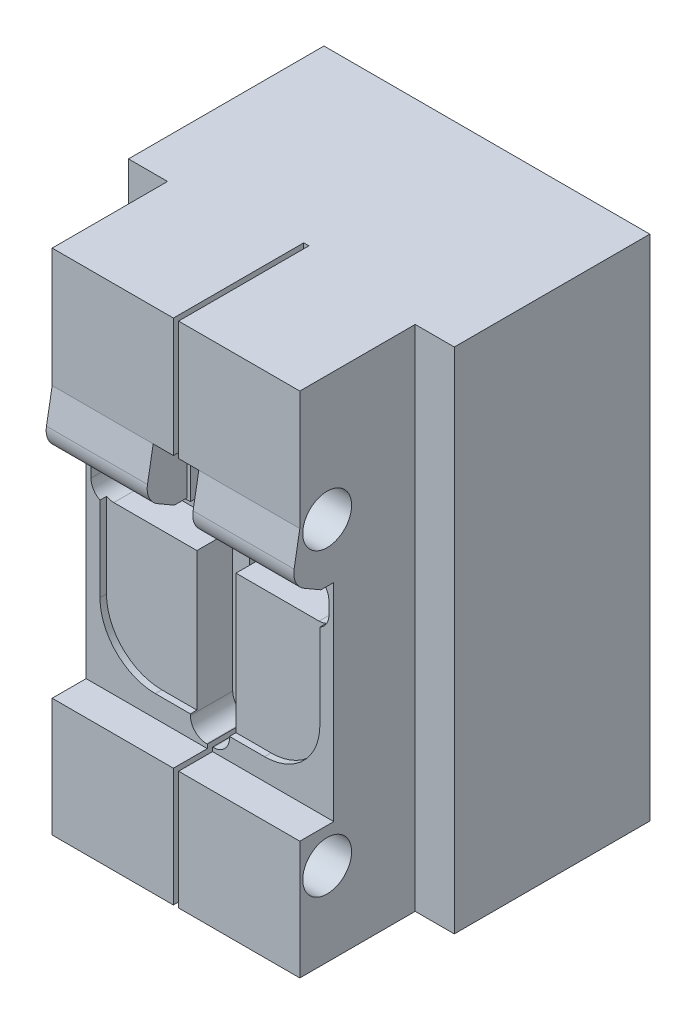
ISO-10303-21;
HEADER;
FILE_DESCRIPTION(('STEP AP214'),'2;1');
FILE_NAME('part.step','',(''),(''),'','','');
FILE_SCHEMA(('AUTOMOTIVE_DESIGN { 1 0 10303 214 1 1 1 1 }'));
ENDSEC;
DATA;
#1=APPLICATION_CONTEXT('core data for automotive mechanical design processes');
#2=APPLICATION_PROTOCOL_DEFINITION('international standard','automotive_design',2000,#1);
#3=PRODUCT_CONTEXT('',#1,'mechanical');
#4=PRODUCT('Part','Part','',(#3));
#5=PRODUCT_RELATED_PRODUCT_CATEGORY('part','',(#4));
#6=PRODUCT_DEFINITION_FORMATION('','',#4);
#7=PRODUCT_DEFINITION_CONTEXT('part definition',#1,'design');
#8=PRODUCT_DEFINITION('design','',#6,#7);
#9=PRODUCT_DEFINITION_SHAPE('','',#8);
#10=(LENGTH_UNIT() NAMED_UNIT(*) SI_UNIT(.MILLI.,.METRE.));
#11=(NAMED_UNIT(*) PLANE_ANGLE_UNIT() SI_UNIT($,.RADIAN.));
#12=(NAMED_UNIT(*) SI_UNIT($,.STERADIAN.) SOLID_ANGLE_UNIT());
#13=UNCERTAINTY_MEASURE_WITH_UNIT(LENGTH_MEASURE(1.E-05),#10,'distance_accuracy_value','');
#14=(GEOMETRIC_REPRESENTATION_CONTEXT(3) GLOBAL_UNCERTAINTY_ASSIGNED_CONTEXT((#13)) GLOBAL_UNIT_ASSIGNED_CONTEXT((#10,
#11,#12)) REPRESENTATION_CONTEXT('',''));
#15=CARTESIAN_POINT('',(0.,0.,0.));
#16=DIRECTION('',(0.,0.,1.));
#17=DIRECTION('',(1.,0.,0.));
#18=AXIS2_PLACEMENT_3D('',#15,#16,#17);
#19=CARTESIAN_POINT('',(0.8,88.6957670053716,-29.5861696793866));
#20=DIRECTION('',(1.,0.,0.));
#21=DIRECTION('',(0.,1.,0.));
#22=AXIS2_PLACEMENT_3D('',#19,#20,#21);
#23=PLANE('',#22);
#24=CARTESIAN_POINT('',(0.800000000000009,39.6948533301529,2.02011907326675));
#25=DIRECTION('',(1.,0.,0.));
#26=DIRECTION('',(0.,1.,0.));
#27=AXIS2_PLACEMENT_3D('',#24,#25,#26);
#28=CIRCLE('',#27,4.49999999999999);
#29=CARTESIAN_POINT('',(0.800000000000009,41.4589011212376,6.15994218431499));
#30=VERTEX_POINT('',#29);
#31=CARTESIAN_POINT('',(0.800000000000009,39.568602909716,-2.47810955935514));
#32=VERTEX_POINT('',#31);
#33=EDGE_CURVE('E53',#30,#32,#28,.F.);
#34=ORIENTED_EDGE('',*,*,#33,.F.);
#35=DIRECTION('',(0.,0.,1.));
#36=VECTOR('',#35,1.);
#37=CARTESIAN_POINT('',(0.799999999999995,41.4589011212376,10.4138303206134));
#38=LINE('',#37,#36);
#39=CARTESIAN_POINT('',(0.800000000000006,41.4589011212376,10.4138303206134));
#40=VERTEX_POINT('',#39);
#41=EDGE_CURVE('E467',#30,#40,#38,.T.);
#42=ORIENTED_EDGE('',*,*,#41,.T.);
#43=DIRECTION('',(0.,1.,0.));
#44=VECTOR('',#43,1.);
#45=CARTESIAN_POINT('',(0.8,88.6957670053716,10.4138303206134));
#46=LINE('',#45,#44);
#47=CARTESIAN_POINT('',(0.800000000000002,78.,10.4138303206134));
#48=VERTEX_POINT('',#47);
#49=EDGE_CURVE('E680',#40,#48,#46,.T.);
#50=ORIENTED_EDGE('',*,*,#49,.T.);
#51=DIRECTION('',(0.,0.,-1.));
#52=VECTOR('',#51,1.);
#53=CARTESIAN_POINT('',(0.800000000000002,78.,-85.));
#54=LINE('',#53,#52);
#55=CARTESIAN_POINT('',(0.800000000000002,78.,-29.5861696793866));
#56=VERTEX_POINT('',#55);
#57=EDGE_CURVE('E477',#48,#56,#54,.T.);
#58=ORIENTED_EDGE('',*,*,#57,.T.);
#59=DIRECTION('',(0.,1.,0.));
#60=VECTOR('',#59,1.);
#61=CARTESIAN_POINT('',(0.8,88.6957670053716,-29.5861696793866));
#62=LINE('',#61,#60);
#63=CARTESIAN_POINT('',(0.800000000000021,-78.,-29.5861696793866));
#64=VERTEX_POINT('',#63);
#65=EDGE_CURVE('E666',#64,#56,#62,.T.);
#66=ORIENTED_EDGE('',*,*,#65,.F.);
#67=DIRECTION('',(0.,0.,1.));
#68=VECTOR('',#67,1.);
#69=CARTESIAN_POINT('',(0.800000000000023,-78.,-85.));
#70=LINE('',#69,#68);
#71=CARTESIAN_POINT('',(0.800000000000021,-78.,10.4138303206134));
#72=VERTEX_POINT('',#71);
#73=EDGE_CURVE('E469',#64,#72,#70,.T.);
#74=ORIENTED_EDGE('',*,*,#73,.T.);
#75=CARTESIAN_POINT('',(0.800000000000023,-41.639468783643,10.4138303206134));
#76=VERTEX_POINT('',#75);
#77=EDGE_CURVE('E68',#72,#76,#46,.T.);
#78=ORIENTED_EDGE('',*,*,#77,.T.);
#79=DIRECTION('',(0.,0.,-1.));
#80=VECTOR('',#79,1.);
#81=CARTESIAN_POINT('',(0.800000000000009,-41.639468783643,0.));
#82=LINE('',#81,#80);
#83=CARTESIAN_POINT('',(0.800000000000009,-41.639468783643,0.));
#84=VERTEX_POINT('',#83);
#85=EDGE_CURVE('E649',#76,#84,#82,.T.);
#86=ORIENTED_EDGE('',*,*,#85,.T.);
#87=DIRECTION('',(0.,1.,0.));
#88=VECTOR('',#87,1.);
#89=CARTESIAN_POINT('',(0.800000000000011,0.,0.));
#90=LINE('',#89,#88);
#91=CARTESIAN_POINT('',(0.800000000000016,-40.431397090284,0.));
#92=VERTEX_POINT('',#91);
#93=EDGE_CURVE('E670',#84,#92,#90,.T.);
#94=ORIENTED_EDGE('',*,*,#93,.T.);
#95=DIRECTION('',(0.,0.,1.));
#96=VECTOR('',#95,1.);
#97=CARTESIAN_POINT('',(0.800000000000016,-40.431397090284,-13.));
#98=LINE('',#97,#96);
#99=CARTESIAN_POINT('',(0.800000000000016,-40.431397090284,-13.));
#100=VERTEX_POINT('',#99);
#101=EDGE_CURVE('E472',#100,#92,#98,.T.);
#102=ORIENTED_EDGE('',*,*,#101,.F.);
#103=DIRECTION('',(0.,1.,0.));
#104=VECTOR('',#103,1.);
#105=CARTESIAN_POINT('',(0.800000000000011,0.,-13.));
#106=LINE('',#105,#104);
#107=CARTESIAN_POINT('',(0.800000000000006,39.568602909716,-13.));
#108=VERTEX_POINT('',#107);
#109=EDGE_CURVE('E466',#100,#108,#106,.T.);
#110=ORIENTED_EDGE('',*,*,#109,.T.);
#111=DIRECTION('',(0.,0.,1.));
#112=VECTOR('',#111,1.);
#113=CARTESIAN_POINT('',(0.800000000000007,39.568602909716,-13.));
#114=LINE('',#113,#112);
#115=EDGE_CURVE('E457',#108,#32,#114,.T.);
#116=ORIENTED_EDGE('',*,*,#115,.T.);
#117=EDGE_LOOP('',(#34,#42,#50,#58,#66,#74,#78,#86,#94,#102,#110,#116));
#118=FACE_BOUND('',#117,.T.);
#119=CARTESIAN_POINT('',(0.800000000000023,-52.352753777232,2.02011907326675));
#120=DIRECTION('',(1.,0.,0.));
#121=DIRECTION('',(0.,1.,0.));
#122=AXIS2_PLACEMENT_3D('',#119,#120,#121);
#123=CIRCLE('',#122,4.49999999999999);
#124=CARTESIAN_POINT('',(0.800000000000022,-47.852753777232,2.02011907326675));
#125=VERTEX_POINT('',#124);
#126=EDGE_CURVE('E1006',#125,#125,#123,.F.);
#127=ORIENTED_EDGE('',*,*,#126,.F.);
#128=EDGE_LOOP('',(#127));
#129=FACE_BOUND('',#128,.T.);
#130=ADVANCED_FACE('F40',(#118,#129),#23,.F.);
#131=CARTESIAN_POINT('',(0.,0.,0.));
#132=DIRECTION('',(0.,0.,1.));
#133=DIRECTION('',(1.,0.,0.));
#134=AXIS2_PLACEMENT_3D('',#131,#132,#133);
#135=PLANE('',#134);
#136=DIRECTION('',(0.,-1.,0.));
#137=VECTOR('',#136,1.);
#138=CARTESIAN_POINT('',(-0.799999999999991,0.,0.));
#139=LINE('',#138,#137);
#140=CARTESIAN_POINT('',(-0.799999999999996,41.4589011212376,0.));
#141=VERTEX_POINT('',#140);
#142=CARTESIAN_POINT('',(-0.799999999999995,39.568602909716,0.));
#143=VERTEX_POINT('',#142);
#144=EDGE_CURVE('E483',#141,#143,#139,.T.);
#145=ORIENTED_EDGE('',*,*,#144,.F.);
#146=DIRECTION('',(1.,0.,0.));
#147=VECTOR('',#146,1.);
#148=CARTESIAN_POINT('',(-75.9960493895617,41.4589011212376,0.));
#149=LINE('',#148,#147);
#150=CARTESIAN_POINT('',(-7.00000000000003,41.4589011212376,0.));
#151=VERTEX_POINT('',#150);
#152=EDGE_CURVE('E535',#151,#141,#149,.T.);
#153=ORIENTED_EDGE('',*,*,#152,.F.);
#154=DIRECTION('',(0.,1.,0.));
#155=VECTOR('',#154,1.);
#156=CARTESIAN_POINT('',(-7.00000000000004,21.9233822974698,0.));
#157=LINE('',#156,#155);
#158=CARTESIAN_POINT('',(-7.00000000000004,21.9233822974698,0.));
#159=VERTEX_POINT('',#158);
#160=EDGE_CURVE('E554',#159,#151,#157,.T.);
#161=ORIENTED_EDGE('',*,*,#160,.F.);
#162=DIRECTION('',(-1.,0.,0.));
#163=VECTOR('',#162,1.);
#164=CARTESIAN_POINT('',(-7.00000000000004,21.9233822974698,0.));
#165=LINE('',#164,#163);
#166=CARTESIAN_POINT('',(-38.,21.9233822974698,0.));
#167=VERTEX_POINT('',#166);
#168=EDGE_CURVE('E577',#159,#167,#165,.T.);
#169=ORIENTED_EDGE('',*,*,#168,.T.);
#170=DIRECTION('',(0.,1.,0.));
#171=VECTOR('',#170,1.);
#172=CARTESIAN_POINT('',(-38.,78.,0.));
#173=LINE('',#172,#171);
#174=CARTESIAN_POINT('',(-38.,-41.639468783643,0.));
#175=VERTEX_POINT('',#174);
#176=EDGE_CURVE('E974',#175,#167,#173,.T.);
#177=ORIENTED_EDGE('',*,*,#176,.F.);
#178=DIRECTION('',(1.,0.,0.));
#179=VECTOR('',#178,1.);
#180=CARTESIAN_POINT('',(-75.8224284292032,-41.639468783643,0.));
#181=LINE('',#180,#179);
#182=CARTESIAN_POINT('',(-0.799999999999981,-41.639468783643,0.));
#183=VERTEX_POINT('',#182);
#184=EDGE_CURVE('E521',#175,#183,#181,.T.);
#185=ORIENTED_EDGE('',*,*,#184,.T.);
#186=CARTESIAN_POINT('',(-0.799999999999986,-40.431397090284,0.));
#187=VERTEX_POINT('',#186);
#188=EDGE_CURVE('E479',#187,#183,#139,.T.);
#189=ORIENTED_EDGE('',*,*,#188,.F.);
#190=DIRECTION('',(1.,0.,0.));
#191=VECTOR('',#190,1.);
#192=CARTESIAN_POINT('',(0.,-40.431397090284,0.));
#193=LINE('',#192,#191);
#194=CARTESIAN_POINT('',(-0.999999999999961,-40.431397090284,0.));
#195=VERTEX_POINT('',#194);
#196=EDGE_CURVE('E701',#195,#187,#193,.T.);
#197=ORIENTED_EDGE('',*,*,#196,.F.);
#198=CARTESIAN_POINT('',(-0.999999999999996,-35.431397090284,0.));
#199=DIRECTION('',(0.,0.,1.));
#200=DIRECTION('',(1.,0.,0.));
#201=AXIS2_PLACEMENT_3D('',#198,#199,#200);
#202=CIRCLE('',#201,5.);
#203=CARTESIAN_POINT('',(-6.,-35.431397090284,0.));
#204=VERTEX_POINT('',#203);
#205=EDGE_CURVE('E702',#204,#195,#202,.T.);
#206=ORIENTED_EDGE('',*,*,#205,.F.);
#207=DIRECTION('',(0.,-1.,0.));
#208=VECTOR('',#207,1.);
#209=CARTESIAN_POINT('',(-5.99999999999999,0.,0.));
#210=LINE('',#209,#208);
#211=CARTESIAN_POINT('',(-6.,-35.,0.));
#212=VERTEX_POINT('',#211);
#213=EDGE_CURVE('E709',#212,#204,#210,.T.);
#214=ORIENTED_EDGE('',*,*,#213,.F.);
#215=DIRECTION('',(1.,0.,0.));
#216=VECTOR('',#215,1.);
#217=CARTESIAN_POINT('',(16.75,-35.,0.));
#218=LINE('',#217,#216);
#219=CARTESIAN_POINT('',(-16.75,-35.,0.));
#220=VERTEX_POINT('',#219);
#221=EDGE_CURVE('E843',#220,#212,#218,.T.);
#222=ORIENTED_EDGE('',*,*,#221,.F.);
#223=CARTESIAN_POINT('',(-16.75,-18.,0.));
#224=DIRECTION('',(0.,0.,1.));
#225=DIRECTION('',(1.,0.,0.));
#226=AXIS2_PLACEMENT_3D('',#223,#224,#225);
#227=CIRCLE('',#226,17.);
#228=CARTESIAN_POINT('',(-33.75,-18.,0.));
#229=VERTEX_POINT('',#228);
#230=EDGE_CURVE('E838',#229,#220,#227,.T.);
#231=ORIENTED_EDGE('',*,*,#230,.F.);
#232=DIRECTION('',(0.,-1.,0.));
#233=VECTOR('',#232,1.);
#234=CARTESIAN_POINT('',(-33.75,-18.,0.));
#235=LINE('',#234,#233);
#236=CARTESIAN_POINT('',(-33.75,7.93485722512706,0.));
#237=VERTEX_POINT('',#236);
#238=EDGE_CURVE('E814',#237,#229,#235,.T.);
#239=ORIENTED_EDGE('',*,*,#238,.F.);
#240=CARTESIAN_POINT('',(-31.5,12.4,0.));
#241=DIRECTION('',(0.,0.,1.));
#242=DIRECTION('',(1.,0.,0.));
#243=AXIS2_PLACEMENT_3D('',#240,#241,#242);
#244=CIRCLE('',#243,5.00000000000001);
#245=CARTESIAN_POINT('',(-36.5,12.4,0.));
#246=VERTEX_POINT('',#245);
#247=EDGE_CURVE('E751',#246,#237,#244,.T.);
#248=ORIENTED_EDGE('',*,*,#247,.F.);
#249=DIRECTION('',(0.,-1.,0.));
#250=VECTOR('',#249,1.);
#251=CARTESIAN_POINT('',(-36.5,0.,0.));
#252=LINE('',#251,#250);
#253=CARTESIAN_POINT('',(-36.5,16.4,0.));
#254=VERTEX_POINT('',#253);
#255=EDGE_CURVE('E748',#254,#246,#252,.T.);
#256=ORIENTED_EDGE('',*,*,#255,.F.);
#257=CARTESIAN_POINT('',(-31.5,16.4,0.));
#258=DIRECTION('',(0.,0.,1.));
#259=DIRECTION('',(1.,0.,0.));
#260=AXIS2_PLACEMENT_3D('',#257,#258,#259);
#261=CIRCLE('',#260,5.);
#262=CARTESIAN_POINT('',(-31.5,21.4,0.));
#263=VERTEX_POINT('',#262);
#264=EDGE_CURVE('E745',#263,#254,#261,.T.);
#265=ORIENTED_EDGE('',*,*,#264,.F.);
#266=DIRECTION('',(1.,0.,0.));
#267=VECTOR('',#266,1.);
#268=CARTESIAN_POINT('',(0.,21.4,0.));
#269=LINE('',#268,#267);
#270=CARTESIAN_POINT('',(-5.99999999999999,21.4,0.));
#271=VERTEX_POINT('',#270);
#272=EDGE_CURVE('E742',#263,#271,#269,.T.);
#273=ORIENTED_EDGE('',*,*,#272,.T.);
#274=DIRECTION('',(0.,-1.,0.));
#275=VECTOR('',#274,1.);
#276=CARTESIAN_POINT('',(-5.99999999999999,0.,0.));
#277=LINE('',#276,#275);
#278=CARTESIAN_POINT('',(-5.99999999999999,34.568602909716,0.));
#279=VERTEX_POINT('',#278);
#280=EDGE_CURVE('E739',#279,#271,#277,.T.);
#281=ORIENTED_EDGE('',*,*,#280,.F.);
#282=CARTESIAN_POINT('',(-0.999999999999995,34.568602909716,0.));
#283=DIRECTION('',(0.,0.,1.));
#284=DIRECTION('',(1.,0.,0.));
#285=AXIS2_PLACEMENT_3D('',#282,#283,#284);
#286=CIRCLE('',#285,5.);
#287=CARTESIAN_POINT('',(-0.999999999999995,39.568602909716,0.));
#288=VERTEX_POINT('',#287);
#289=EDGE_CURVE('E736',#288,#279,#286,.T.);
#290=ORIENTED_EDGE('',*,*,#289,.F.);
#291=DIRECTION('',(1.,0.,0.));
#292=VECTOR('',#291,1.);
#293=CARTESIAN_POINT('',(0.,39.568602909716,0.));
#294=LINE('',#293,#292);
#295=EDGE_CURVE('E733',#288,#143,#294,.T.);
#296=ORIENTED_EDGE('',*,*,#295,.T.);
#297=EDGE_LOOP('',(#145,#153,#161,#169,#177,#185,#189,#197,#206,#214,#222,#231,#239,#248,#256,
#265,#273,#281,#290,#296));
#298=FACE_BOUND('',#297,.T.);
#299=ADVANCED_FACE('F1075',(#298),#135,.T.);
#300=CARTESIAN_POINT('',(0.,39.568602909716,-13.));
#301=DIRECTION('',(0.,-1.,0.));
#302=DIRECTION('',(0.,0.,-1.));
#303=AXIS2_PLACEMENT_3D('',#300,#301,#302);
#304=PLANE('',#303);
#305=DIRECTION('',(0.,0.,-1.));
#306=VECTOR('',#305,1.);
#307=CARTESIAN_POINT('',(-0.799999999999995,39.568602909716,-13.));
#308=LINE('',#307,#306);
#309=CARTESIAN_POINT('',(-0.799999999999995,39.568602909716,-13.));
#310=VERTEX_POINT('',#309);
#311=EDGE_CURVE('E490',#143,#310,#308,.T.);
#312=ORIENTED_EDGE('',*,*,#311,.F.);
#313=ORIENTED_EDGE('',*,*,#295,.F.);
#314=DIRECTION('',(0.,0.,1.));
#315=VECTOR('',#314,1.);
#316=CARTESIAN_POINT('',(-0.999999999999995,39.568602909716,-13.));
#317=LINE('',#316,#315);
#318=CARTESIAN_POINT('',(-0.999999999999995,39.568602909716,-13.));
#319=VERTEX_POINT('',#318);
#320=EDGE_CURVE('E768',#319,#288,#317,.T.);
#321=ORIENTED_EDGE('',*,*,#320,.F.);
#322=DIRECTION('',(1.,0.,0.));
#323=VECTOR('',#322,1.);
#324=CARTESIAN_POINT('',(0.,39.568602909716,-13.));
#325=LINE('',#324,#323);
#326=EDGE_CURVE('E946',#319,#310,#325,.T.);
#327=ORIENTED_EDGE('',*,*,#326,.T.);
#328=EDGE_LOOP('',(#312,#313,#321,#327));
#329=FACE_BOUND('',#328,.T.);
#330=ADVANCED_FACE('F1080',(#329),#304,.T.);
#331=CARTESIAN_POINT('',(0.,-40.431397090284,-13.));
#332=DIRECTION('',(0.,-1.,0.));
#333=DIRECTION('',(0.,0.,-1.));
#334=AXIS2_PLACEMENT_3D('',#331,#332,#333);
#335=PLANE('',#334);
#336=ORIENTED_EDGE('',*,*,#196,.T.);
#337=DIRECTION('',(0.,0.,-1.));
#338=VECTOR('',#337,1.);
#339=CARTESIAN_POINT('',(-0.799999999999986,-40.431397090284,-13.));
#340=LINE('',#339,#338);
#341=CARTESIAN_POINT('',(-0.799999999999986,-40.431397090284,-13.));
#342=VERTEX_POINT('',#341);
#343=EDGE_CURVE('E482',#187,#342,#340,.T.);
#344=ORIENTED_EDGE('',*,*,#343,.T.);
#345=DIRECTION('',(1.,0.,0.));
#346=VECTOR('',#345,1.);
#347=CARTESIAN_POINT('',(0.,-40.431397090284,-13.));
#348=LINE('',#347,#346);
#349=CARTESIAN_POINT('',(-0.999999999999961,-40.431397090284,-13.));
#350=VERTEX_POINT('',#349);
#351=EDGE_CURVE('E987',#350,#342,#348,.T.);
#352=ORIENTED_EDGE('',*,*,#351,.F.);
#353=DIRECTION('',(0.,0.,1.));
#354=VECTOR('',#353,1.);
#355=CARTESIAN_POINT('',(-0.999999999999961,-40.431397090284,-13.));
#356=LINE('',#355,#354);
#357=EDGE_CURVE('E794',#350,#195,#356,.T.);
#358=ORIENTED_EDGE('',*,*,#357,.T.);
#359=EDGE_LOOP('',(#336,#344,#352,#358));
#360=FACE_BOUND('',#359,.T.);
#361=ADVANCED_FACE('F1213',(#360),#335,.F.);
#362=CARTESIAN_POINT('',(0.,0.,-13.));
#363=DIRECTION('',(0.,0.,1.));
#364=DIRECTION('',(1.,0.,0.));
#365=AXIS2_PLACEMENT_3D('',#362,#363,#364);
#366=PLANE('',#365);
#367=DIRECTION('',(0.,-1.,0.));
#368=VECTOR('',#367,1.);
#369=CARTESIAN_POINT('',(-0.799999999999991,0.,-13.));
#370=LINE('',#369,#368);
#371=EDGE_CURVE('E487',#310,#342,#370,.T.);
#372=ORIENTED_EDGE('',*,*,#371,.F.);
#373=ORIENTED_EDGE('',*,*,#326,.F.);
#374=CARTESIAN_POINT('',(-0.999999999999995,34.568602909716,-13.));
#375=DIRECTION('',(0.,0.,1.));
#376=DIRECTION('',(1.,0.,0.));
#377=AXIS2_PLACEMENT_3D('',#374,#375,#376);
#378=CIRCLE('',#377,5.);
#379=CARTESIAN_POINT('',(-5.99999999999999,34.568602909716,-13.));
#380=VERTEX_POINT('',#379);
#381=EDGE_CURVE('E949',#319,#380,#378,.T.);
#382=ORIENTED_EDGE('',*,*,#381,.T.);
#383=DIRECTION('',(0.,-1.,0.));
#384=VECTOR('',#383,1.);
#385=CARTESIAN_POINT('',(-5.99999999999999,0.,-13.));
#386=LINE('',#385,#384);
#387=CARTESIAN_POINT('',(-5.99999999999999,21.4,-13.));
#388=VERTEX_POINT('',#387);
#389=EDGE_CURVE('E952',#380,#388,#386,.T.);
#390=ORIENTED_EDGE('',*,*,#389,.T.);
#391=DIRECTION('',(1.,0.,0.));
#392=VECTOR('',#391,1.);
#393=CARTESIAN_POINT('',(0.,21.4,-13.));
#394=LINE('',#393,#392);
#395=CARTESIAN_POINT('',(-31.5,21.4,-13.));
#396=VERTEX_POINT('',#395);
#397=EDGE_CURVE('E955',#396,#388,#394,.T.);
#398=ORIENTED_EDGE('',*,*,#397,.F.);
#399=CARTESIAN_POINT('',(-31.5,16.4,-13.));
#400=DIRECTION('',(0.,0.,1.));
#401=DIRECTION('',(1.,0.,0.));
#402=AXIS2_PLACEMENT_3D('',#399,#400,#401);
#403=CIRCLE('',#402,5.);
#404=CARTESIAN_POINT('',(-36.5,16.4,-13.));
#405=VERTEX_POINT('',#404);
#406=EDGE_CURVE('E957',#396,#405,#403,.T.);
#407=ORIENTED_EDGE('',*,*,#406,.T.);
#408=DIRECTION('',(0.,-1.,0.));
#409=VECTOR('',#408,1.);
#410=CARTESIAN_POINT('',(-36.5,0.,-13.));
#411=LINE('',#410,#409);
#412=CARTESIAN_POINT('',(-36.5,12.4,-13.));
#413=VERTEX_POINT('',#412);
#414=EDGE_CURVE('E960',#405,#413,#411,.T.);
#415=ORIENTED_EDGE('',*,*,#414,.T.);
#416=CARTESIAN_POINT('',(-31.5,12.4,-13.));
#417=DIRECTION('',(0.,0.,1.));
#418=DIRECTION('',(1.,0.,0.));
#419=AXIS2_PLACEMENT_3D('',#416,#417,#418);
#420=CIRCLE('',#419,5.00000000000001);
#421=CARTESIAN_POINT('',(-31.5,7.39999999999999,-13.));
#422=VERTEX_POINT('',#421);
#423=EDGE_CURVE('E803',#413,#422,#420,.T.);
#424=ORIENTED_EDGE('',*,*,#423,.T.);
#425=DIRECTION('',(1.,0.,0.));
#426=VECTOR('',#425,1.);
#427=CARTESIAN_POINT('',(0.,7.39999999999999,-13.));
#428=LINE('',#427,#426);
#429=CARTESIAN_POINT('',(-5.99999999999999,7.39999999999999,-13.));
#430=VERTEX_POINT('',#429);
#431=EDGE_CURVE('E753',#422,#430,#428,.T.);
#432=ORIENTED_EDGE('',*,*,#431,.T.);
#433=DIRECTION('',(0.,-1.,0.));
#434=VECTOR('',#433,1.);
#435=CARTESIAN_POINT('',(-5.99999999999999,0.,-13.));
#436=LINE('',#435,#434);
#437=CARTESIAN_POINT('',(-6.,-35.431397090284,-13.));
#438=VERTEX_POINT('',#437);
#439=EDGE_CURVE('E980',#430,#438,#436,.T.);
#440=ORIENTED_EDGE('',*,*,#439,.T.);
#441=CARTESIAN_POINT('',(-0.999999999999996,-35.431397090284,-13.));
#442=DIRECTION('',(0.,0.,1.));
#443=DIRECTION('',(1.,0.,0.));
#444=AXIS2_PLACEMENT_3D('',#441,#442,#443);
#445=CIRCLE('',#444,5.);
#446=EDGE_CURVE('E984',#438,#350,#445,.T.);
#447=ORIENTED_EDGE('',*,*,#446,.T.);
#448=ORIENTED_EDGE('',*,*,#351,.T.);
#449=EDGE_LOOP('',(#372,#373,#382,#390,#398,#407,#415,#424,#432,#440,#447,#448));
#450=FACE_BOUND('',#449,.T.);
#451=ADVANCED_FACE('F1247',(#450),#366,.T.);
#452=CARTESIAN_POINT('',(-75.9960493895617,41.4589011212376,10.4138303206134));
#453=DIRECTION('',(0.,-1.,0.));
#454=DIRECTION('',(1.,0.,0.));
#455=AXIS2_PLACEMENT_3D('',#452,#453,#454);
#456=PLANE('',#455);
#457=DIRECTION('',(0.,0.,-1.));
#458=VECTOR('',#457,1.);
#459=CARTESIAN_POINT('',(-0.799999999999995,41.4589011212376,10.4138303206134));
#460=LINE('',#459,#458);
#461=CARTESIAN_POINT('',(-0.799999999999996,41.4589011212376,10.4138303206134));
#462=VERTEX_POINT('',#461);
#463=EDGE_CURVE('E492',#462,#141,#460,.T.);
#464=ORIENTED_EDGE('',*,*,#463,.F.);
#465=DIRECTION('',(1.,0.,0.));
#466=VECTOR('',#465,1.);
#467=CARTESIAN_POINT('',(-75.9960493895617,41.4589011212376,10.4138303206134));
#468=LINE('',#467,#466);
#469=CARTESIAN_POINT('',(-7.00000000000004,41.4589011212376,10.4138303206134));
#470=VERTEX_POINT('',#469);
#471=EDGE_CURVE('E532',#470,#462,#468,.T.);
#472=ORIENTED_EDGE('',*,*,#471,.F.);
#473=DIRECTION('',(0.,0.,1.));
#474=VECTOR('',#473,1.);
#475=CARTESIAN_POINT('',(-7.00000000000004,41.4589011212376,0.));
#476=LINE('',#475,#474);
#477=EDGE_CURVE('E551',#151,#470,#476,.T.);
#478=ORIENTED_EDGE('',*,*,#477,.F.);
#479=ORIENTED_EDGE('',*,*,#152,.T.);
#480=EDGE_LOOP('',(#464,#472,#478,#479));
#481=FACE_BOUND('',#480,.T.);
#482=ADVANCED_FACE('F1107',(#481),#456,.T.);
#483=CARTESIAN_POINT('',(-75.9960493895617,41.4589011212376,10.4138303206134));
#484=DIRECTION('',(0.,0.,1.));
#485=DIRECTION('',(1.,0.,0.));
#486=AXIS2_PLACEMENT_3D('',#483,#484,#485);
#487=PLANE('',#486);
#488=DIRECTION('',(0.,-1.,0.));
#489=VECTOR('',#488,1.);
#490=CARTESIAN_POINT('',(-0.800000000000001,88.6957670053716,10.4138303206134));
#491=LINE('',#490,#489);
#492=CARTESIAN_POINT('',(-0.8,78.,10.4138303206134));
#493=VERTEX_POINT('',#492);
#494=EDGE_CURVE('E679',#493,#462,#491,.T.);
#495=ORIENTED_EDGE('',*,*,#494,.F.);
#496=DIRECTION('',(1.,0.,0.));
#497=VECTOR('',#496,1.);
#498=CARTESIAN_POINT('',(-75.9960493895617,78.,10.4138303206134));
#499=LINE('',#498,#497);
#500=CARTESIAN_POINT('',(-38.,78.,10.4138303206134));
#501=VERTEX_POINT('',#500);
#502=EDGE_CURVE('E539',#501,#493,#499,.T.);
#503=ORIENTED_EDGE('',*,*,#502,.F.);
#504=DIRECTION('',(0.,1.,0.));
#505=VECTOR('',#504,1.);
#506=CARTESIAN_POINT('',(-38.,41.4589011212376,10.4138303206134));
#507=LINE('',#506,#505);
#508=CARTESIAN_POINT('',(-38.,41.4589011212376,10.4138303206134));
#509=VERTEX_POINT('',#508);
#510=EDGE_CURVE('E528',#509,#501,#507,.T.);
#511=ORIENTED_EDGE('',*,*,#510,.F.);
#512=DIRECTION('',(-1.,0.,0.));
#513=VECTOR('',#512,1.);
#514=CARTESIAN_POINT('',(-7.00000000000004,41.4589011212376,10.4138303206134));
#515=LINE('',#514,#513);
#516=EDGE_CURVE('E580',#470,#509,#515,.T.);
#517=ORIENTED_EDGE('',*,*,#516,.F.);
#518=ORIENTED_EDGE('',*,*,#471,.T.);
#519=EDGE_LOOP('',(#495,#503,#511,#517,#518));
#520=FACE_BOUND('',#519,.T.);
#521=ADVANCED_FACE('F1102',(#520),#487,.T.);
#522=CARTESIAN_POINT('',(-75.8224284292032,-41.639468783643,10.4138303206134));
#523=DIRECTION('',(0.,0.,1.));
#524=DIRECTION('',(0.,-1.,0.));
#525=AXIS2_PLACEMENT_3D('',#522,#523,#524);
#526=PLANE('',#525);
#527=CARTESIAN_POINT('',(-0.799999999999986,-41.639468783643,10.4138303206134));
#528=VERTEX_POINT('',#527);
#529=CARTESIAN_POINT('',(-0.799999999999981,-78.,10.4138303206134));
#530=VERTEX_POINT('',#529);
#531=EDGE_CURVE('E677',#528,#530,#491,.T.);
#532=ORIENTED_EDGE('',*,*,#531,.F.);
#533=DIRECTION('',(1.,0.,0.));
#534=VECTOR('',#533,1.);
#535=CARTESIAN_POINT('',(-75.8224284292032,-41.639468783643,10.4138303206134));
#536=LINE('',#535,#534);
#537=CARTESIAN_POINT('',(-38.,-41.639468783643,10.4138303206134));
#538=VERTEX_POINT('',#537);
#539=EDGE_CURVE('E517',#538,#528,#536,.T.);
#540=ORIENTED_EDGE('',*,*,#539,.F.);
#541=DIRECTION('',(0.,1.,0.));
#542=VECTOR('',#541,1.);
#543=CARTESIAN_POINT('',(-38.,-41.639468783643,10.4138303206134));
#544=LINE('',#543,#542);
#545=CARTESIAN_POINT('',(-38.,-78.,10.4138303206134));
#546=VERTEX_POINT('',#545);
#547=EDGE_CURVE('E502',#546,#538,#544,.T.);
#548=ORIENTED_EDGE('',*,*,#547,.F.);
#549=DIRECTION('',(1.,0.,0.));
#550=VECTOR('',#549,1.);
#551=CARTESIAN_POINT('',(-75.8224284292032,-78.,10.4138303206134));
#552=LINE('',#551,#550);
#553=EDGE_CURVE('E505',#546,#530,#552,.T.);
#554=ORIENTED_EDGE('',*,*,#553,.T.);
#555=EDGE_LOOP('',(#532,#540,#548,#554));
#556=FACE_BOUND('',#555,.T.);
#557=ADVANCED_FACE('F1094',(#556),#526,.T.);
#558=CARTESIAN_POINT('',(-75.8224284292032,-41.639468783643,0.));
#559=DIRECTION('',(0.,1.,0.));
#560=DIRECTION('',(-1.,0.,0.));
#561=AXIS2_PLACEMENT_3D('',#558,#559,#560);
#562=PLANE('',#561);
#563=DIRECTION('',(0.,0.,1.));
#564=VECTOR('',#563,1.);
#565=CARTESIAN_POINT('',(-0.799999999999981,-41.639468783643,0.));
#566=LINE('',#565,#564);
#567=EDGE_CURVE('E652',#183,#528,#566,.T.);
#568=ORIENTED_EDGE('',*,*,#567,.F.);
#569=ORIENTED_EDGE('',*,*,#184,.F.);
#570=DIRECTION('',(0.,0.,-1.));
#571=VECTOR('',#570,1.);
#572=CARTESIAN_POINT('',(-38.,-41.639468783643,0.));
#573=LINE('',#572,#571);
#574=EDGE_CURVE('E504',#538,#175,#573,.T.);
#575=ORIENTED_EDGE('',*,*,#574,.F.);
#576=ORIENTED_EDGE('',*,*,#539,.T.);
#577=EDGE_LOOP('',(#568,#569,#575,#576));
#578=FACE_BOUND('',#577,.T.);
#579=ADVANCED_FACE('F1097',(#578),#562,.T.);
#580=DIRECTION('',(1.,0.,0.));
#581=VECTOR('',#580,1.);
#582=CARTESIAN_POINT('',(38.,35.6737690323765,0.));
#583=LINE('',#582,#581);
#584=CARTESIAN_POINT('',(5.87633139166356,35.6737690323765,0.));
#585=VERTEX_POINT('',#584);
#586=CARTESIAN_POINT('',(7.00000000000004,35.6737690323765,0.));
#587=VERTEX_POINT('',#586);
#588=EDGE_CURVE('E461',#585,#587,#583,.T.);
#589=ORIENTED_EDGE('',*,*,#588,.F.);
#590=CARTESIAN_POINT('',(1.00000000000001,34.568602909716,0.));
#591=DIRECTION('',(0.,0.,1.));
#592=DIRECTION('',(1.,0.,0.));
#593=AXIS2_PLACEMENT_3D('',#590,#591,#592);
#594=CIRCLE('',#593,5.);
#595=CARTESIAN_POINT('',(6.00000000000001,34.568602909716,0.));
#596=VERTEX_POINT('',#595);
#597=EDGE_CURVE('E731',#585,#596,#594,.F.);
#598=ORIENTED_EDGE('',*,*,#597,.T.);
#599=DIRECTION('',(0.,-1.,0.));
#600=VECTOR('',#599,1.);
#601=CARTESIAN_POINT('',(6.00000000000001,0.,0.));
#602=LINE('',#601,#600);
#603=CARTESIAN_POINT('',(6.00000000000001,21.4,0.));
#604=VERTEX_POINT('',#603);
#605=EDGE_CURVE('E728',#596,#604,#602,.T.);
#606=ORIENTED_EDGE('',*,*,#605,.T.);
#607=DIRECTION('',(1.,0.,0.));
#608=VECTOR('',#607,1.);
#609=CARTESIAN_POINT('',(0.,21.4,0.));
#610=LINE('',#609,#608);
#611=CARTESIAN_POINT('',(31.5,21.4,0.));
#612=VERTEX_POINT('',#611);
#613=EDGE_CURVE('E725',#604,#612,#610,.T.);
#614=ORIENTED_EDGE('',*,*,#613,.T.);
#615=CARTESIAN_POINT('',(31.5,16.4,0.));
#616=DIRECTION('',(0.,0.,1.));
#617=DIRECTION('',(1.,0.,0.));
#618=AXIS2_PLACEMENT_3D('',#615,#616,#617);
#619=CIRCLE('',#618,5.);
#620=CARTESIAN_POINT('',(36.5,16.4,0.));
#621=VERTEX_POINT('',#620);
#622=EDGE_CURVE('E722',#612,#621,#619,.F.);
#623=ORIENTED_EDGE('',*,*,#622,.T.);
#624=DIRECTION('',(0.,-1.,0.));
#625=VECTOR('',#624,1.);
#626=CARTESIAN_POINT('',(36.5,0.,0.));
#627=LINE('',#626,#625);
#628=CARTESIAN_POINT('',(36.5,12.4,0.));
#629=VERTEX_POINT('',#628);
#630=EDGE_CURVE('E719',#621,#629,#627,.T.);
#631=ORIENTED_EDGE('',*,*,#630,.T.);
#632=CARTESIAN_POINT('',(31.5,12.4,0.));
#633=DIRECTION('',(0.,0.,1.));
#634=DIRECTION('',(1.,0.,0.));
#635=AXIS2_PLACEMENT_3D('',#632,#633,#634);
#636=CIRCLE('',#635,5.);
#637=CARTESIAN_POINT('',(33.75,7.93485722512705,0.));
#638=VERTEX_POINT('',#637);
#639=EDGE_CURVE('E717',#638,#629,#636,.T.);
#640=ORIENTED_EDGE('',*,*,#639,.F.);
#641=DIRECTION('',(0.,1.,0.));
#642=VECTOR('',#641,1.);
#643=CARTESIAN_POINT('',(33.75,14.4049582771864,0.));
#644=LINE('',#643,#642);
#645=CARTESIAN_POINT('',(33.75,-18.,0.));
#646=VERTEX_POINT('',#645);
#647=EDGE_CURVE('E819',#646,#638,#644,.T.);
#648=ORIENTED_EDGE('',*,*,#647,.F.);
#649=CARTESIAN_POINT('',(16.75,-18.,0.));
#650=DIRECTION('',(0.,0.,1.));
#651=DIRECTION('',(1.,0.,0.));
#652=AXIS2_PLACEMENT_3D('',#649,#650,#651);
#653=CIRCLE('',#652,17.);
#654=CARTESIAN_POINT('',(16.75,-35.,0.));
#655=VERTEX_POINT('',#654);
#656=EDGE_CURVE('E846',#655,#646,#653,.T.);
#657=ORIENTED_EDGE('',*,*,#656,.F.);
#658=CARTESIAN_POINT('',(6.,-35.,0.));
#659=VERTEX_POINT('',#658);
#660=EDGE_CURVE('E842',#659,#655,#218,.T.);
#661=ORIENTED_EDGE('',*,*,#660,.F.);
#662=DIRECTION('',(0.,-1.,0.));
#663=VECTOR('',#662,1.);
#664=CARTESIAN_POINT('',(6.00000000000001,0.,0.));
#665=LINE('',#664,#663);
#666=CARTESIAN_POINT('',(6.,-35.431397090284,0.));
#667=VERTEX_POINT('',#666);
#668=EDGE_CURVE('E715',#659,#667,#665,.T.);
#669=ORIENTED_EDGE('',*,*,#668,.T.);
#670=CARTESIAN_POINT('',(0.999999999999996,-35.431397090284,0.));
#671=DIRECTION('',(0.,0.,1.));
#672=DIRECTION('',(1.,0.,0.));
#673=AXIS2_PLACEMENT_3D('',#670,#671,#672);
#674=CIRCLE('',#673,5.);
#675=CARTESIAN_POINT('',(0.99999999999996,-40.431397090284,0.));
#676=VERTEX_POINT('',#675);
#677=EDGE_CURVE('E700',#676,#667,#674,.T.);
#678=ORIENTED_EDGE('',*,*,#677,.F.);
#679=EDGE_CURVE('E689',#92,#676,#193,.T.);
#680=ORIENTED_EDGE('',*,*,#679,.F.);
#681=ORIENTED_EDGE('',*,*,#93,.F.);
#682=CARTESIAN_POINT('',(38.,-41.639468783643,0.));
#683=VERTEX_POINT('',#682);
#684=EDGE_CURVE('E513',#84,#683,#181,.T.);
#685=ORIENTED_EDGE('',*,*,#684,.T.);
#686=DIRECTION('',(0.,-1.,0.));
#687=VECTOR('',#686,1.);
#688=CARTESIAN_POINT('',(38.,78.,0.));
#689=LINE('',#688,#687);
#690=CARTESIAN_POINT('',(38.,21.9233822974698,0.));
#691=VERTEX_POINT('',#690);
#692=EDGE_CURVE('E614',#691,#683,#689,.T.);
#693=ORIENTED_EDGE('',*,*,#692,.F.);
#694=DIRECTION('',(1.,0.,0.));
#695=VECTOR('',#694,1.);
#696=CARTESIAN_POINT('',(7.00000000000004,21.9233822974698,0.));
#697=LINE('',#696,#695);
#698=CARTESIAN_POINT('',(7.00000000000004,21.9233822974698,0.));
#699=VERTEX_POINT('',#698);
#700=EDGE_CURVE('E617',#699,#691,#697,.T.);
#701=ORIENTED_EDGE('',*,*,#700,.F.);
#702=DIRECTION('',(0.,1.,0.));
#703=VECTOR('',#702,1.);
#704=CARTESIAN_POINT('',(7.00000000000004,21.9233822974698,0.));
#705=LINE('',#704,#703);
#706=EDGE_CURVE('E595',#699,#587,#705,.T.);
#707=ORIENTED_EDGE('',*,*,#706,.T.);
#708=EDGE_LOOP('',(#589,#598,#606,#614,#623,#631,#640,#648,#657,#661,#669,#678,#680,#681,#685,
#693,#701,#707));
#709=FACE_BOUND('',#708,.T.);
#710=ADVANCED_FACE('F696',(#709),#135,.T.);
#711=CARTESIAN_POINT('',(-50.,78.,-85.));
#712=DIRECTION('',(-1.,0.,0.));
#713=DIRECTION('',(0.,0.,1.));
#714=AXIS2_PLACEMENT_3D('',#711,#712,#713);
#715=PLANE('',#714);
#716=DIRECTION('',(0.,0.,1.));
#717=VECTOR('',#716,1.);
#718=CARTESIAN_POINT('',(-50.,-78.,-85.));
#719=LINE('',#718,#717);
#720=CARTESIAN_POINT('',(-50.,-78.,-85.));
#721=VERTEX_POINT('',#720);
#722=CARTESIAN_POINT('',(-50.,-78.,-25.));
#723=VERTEX_POINT('',#722);
#724=EDGE_CURVE('E877',#721,#723,#719,.T.);
#725=ORIENTED_EDGE('',*,*,#724,.T.);
#726=DIRECTION('',(0.,-1.,0.));
#727=VECTOR('',#726,1.);
#728=CARTESIAN_POINT('',(-50.,78.,-25.));
#729=LINE('',#728,#727);
#730=CARTESIAN_POINT('',(-50.,78.,-25.));
#731=VERTEX_POINT('',#730);
#732=EDGE_CURVE('E1174',#731,#723,#729,.T.);
#733=ORIENTED_EDGE('',*,*,#732,.F.);
#734=DIRECTION('',(0.,0.,1.));
#735=VECTOR('',#734,1.);
#736=CARTESIAN_POINT('',(-50.,78.,-85.));
#737=LINE('',#736,#735);
#738=CARTESIAN_POINT('',(-50.,78.,-85.));
#739=VERTEX_POINT('',#738);
#740=EDGE_CURVE('E878',#739,#731,#737,.T.);
#741=ORIENTED_EDGE('',*,*,#740,.F.);
#742=DIRECTION('',(0.,-1.,0.));
#743=VECTOR('',#742,1.);
#744=CARTESIAN_POINT('',(-50.,78.,-85.));
#745=LINE('',#744,#743);
#746=EDGE_CURVE('E856',#739,#721,#745,.T.);
#747=ORIENTED_EDGE('',*,*,#746,.T.);
#748=EDGE_LOOP('',(#725,#733,#741,#747));
#749=FACE_BOUND('',#748,.T.);
#750=ADVANCED_FACE('F42',(#749),#715,.T.);
#751=CARTESIAN_POINT('',(16.75,-35.,-2.));
#752=DIRECTION('',(0.,-1.,0.));
#753=DIRECTION('',(1.,0.,0.));
#754=AXIS2_PLACEMENT_3D('',#751,#752,#753);
#755=PLANE('',#754);
#756=DIRECTION('',(0.,0.,-1.));
#757=VECTOR('',#756,1.);
#758=CARTESIAN_POINT('',(5.99999999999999,-35.,-2.));
#759=LINE('',#758,#757);
#760=CARTESIAN_POINT('',(6.,-35.,-2.));
#761=VERTEX_POINT('',#760);
#762=EDGE_CURVE('E806',#659,#761,#759,.T.);
#763=ORIENTED_EDGE('',*,*,#762,.F.);
#764=ORIENTED_EDGE('',*,*,#660,.T.);
#765=DIRECTION('',(0.,0.,1.));
#766=VECTOR('',#765,1.);
#767=CARTESIAN_POINT('',(16.75,-35.,-2.));
#768=LINE('',#767,#766);
#769=CARTESIAN_POINT('',(16.75,-35.,-2.));
#770=VERTEX_POINT('',#769);
#771=EDGE_CURVE('E857',#770,#655,#768,.T.);
#772=ORIENTED_EDGE('',*,*,#771,.F.);
#773=DIRECTION('',(1.,0.,0.));
#774=VECTOR('',#773,1.);
#775=CARTESIAN_POINT('',(16.75,-35.,-2.));
#776=LINE('',#775,#774);
#777=EDGE_CURVE('E823',#761,#770,#776,.T.);
#778=ORIENTED_EDGE('',*,*,#777,.F.);
#779=EDGE_LOOP('',(#763,#764,#772,#778));
#780=FACE_BOUND('',#779,.T.);
#781=ADVANCED_FACE('F1003',(#780),#755,.F.);
#782=CARTESIAN_POINT('',(16.75,-18.,-2.));
#783=DIRECTION('',(0.,0.,1.));
#784=DIRECTION('',(1.,0.,0.));
#785=AXIS2_PLACEMENT_3D('',#782,#783,#784);
#786=PLANE('',#785);
#787=CARTESIAN_POINT('',(31.5,12.4,-2.));
#788=DIRECTION('',(0.,0.,1.));
#789=DIRECTION('',(1.,0.,0.));
#790=AXIS2_PLACEMENT_3D('',#787,#788,#789);
#791=CIRCLE('',#790,5.);
#792=CARTESIAN_POINT('',(31.5,7.39999999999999,-2.));
#793=VERTEX_POINT('',#792);
#794=CARTESIAN_POINT('',(33.75,7.93485722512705,-2.));
#795=VERTEX_POINT('',#794);
#796=EDGE_CURVE('E640',#793,#795,#791,.T.);
#797=ORIENTED_EDGE('',*,*,#796,.F.);
#798=DIRECTION('',(1.,0.,0.));
#799=VECTOR('',#798,1.);
#800=CARTESIAN_POINT('',(16.75,7.39999999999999,-2.));
#801=LINE('',#800,#799);
#802=CARTESIAN_POINT('',(6.00000000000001,7.39999999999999,-2.));
#803=VERTEX_POINT('',#802);
#804=EDGE_CURVE('E900',#803,#793,#801,.T.);
#805=ORIENTED_EDGE('',*,*,#804,.F.);
#806=DIRECTION('',(0.,-1.,0.));
#807=VECTOR('',#806,1.);
#808=CARTESIAN_POINT('',(6.,-18.,-2.));
#809=LINE('',#808,#807);
#810=EDGE_CURVE('E897',#803,#761,#809,.T.);
#811=ORIENTED_EDGE('',*,*,#810,.T.);
#812=ORIENTED_EDGE('',*,*,#777,.T.);
#813=CARTESIAN_POINT('',(16.75,-18.,-2.));
#814=DIRECTION('',(0.,0.,1.));
#815=DIRECTION('',(1.,0.,0.));
#816=AXIS2_PLACEMENT_3D('',#813,#814,#815);
#817=CIRCLE('',#816,17.);
#818=CARTESIAN_POINT('',(33.75,-18.,-2.));
#819=VERTEX_POINT('',#818);
#820=EDGE_CURVE('E827',#770,#819,#817,.T.);
#821=ORIENTED_EDGE('',*,*,#820,.T.);
#822=DIRECTION('',(0.,1.,0.));
#823=VECTOR('',#822,1.);
#824=CARTESIAN_POINT('',(33.75,14.4049582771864,-2.));
#825=LINE('',#824,#823);
#826=EDGE_CURVE('E831',#819,#795,#825,.T.);
#827=ORIENTED_EDGE('',*,*,#826,.T.);
#828=EDGE_LOOP('',(#797,#805,#811,#812,#821,#827));
#829=FACE_BOUND('',#828,.T.);
#830=ADVANCED_FACE('F913',(#829),#786,.T.);
#831=CARTESIAN_POINT('',(-50.,78.,-85.));
#832=DIRECTION('',(0.,1.,0.));
#833=DIRECTION('',(0.,0.,1.));
#834=AXIS2_PLACEMENT_3D('',#831,#832,#833);
#835=PLANE('',#834);
#836=DIRECTION('',(0.,0.,1.));
#837=VECTOR('',#836,1.);
#838=CARTESIAN_POINT('',(-0.800000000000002,78.,-85.));
#839=LINE('',#838,#837);
#840=CARTESIAN_POINT('',(-0.8,78.,-29.5861696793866));
#841=VERTEX_POINT('',#840);
#842=EDGE_CURVE('E496',#841,#493,#839,.T.);
#843=ORIENTED_EDGE('',*,*,#842,.F.);
#844=DIRECTION('',(1.,0.,0.));
#845=VECTOR('',#844,1.);
#846=CARTESIAN_POINT('',(-50.,78.,-29.5861696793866));
#847=LINE('',#846,#845);
#848=EDGE_CURVE('E498',#841,#56,#847,.T.);
#849=ORIENTED_EDGE('',*,*,#848,.T.);
#850=ORIENTED_EDGE('',*,*,#57,.F.);
#851=CARTESIAN_POINT('',(38.,78.,10.4138303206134));
#852=VERTEX_POINT('',#851);
#853=EDGE_CURVE('E542',#48,#852,#499,.T.);
#854=ORIENTED_EDGE('',*,*,#853,.T.);
#855=DIRECTION('',(0.,0.,1.));
#856=VECTOR('',#855,1.);
#857=CARTESIAN_POINT('',(38.,78.,-25.));
#858=LINE('',#857,#856);
#859=CARTESIAN_POINT('',(38.,78.,-25.));
#860=VERTEX_POINT('',#859);
#861=EDGE_CURVE('E630',#860,#852,#858,.T.);
#862=ORIENTED_EDGE('',*,*,#861,.F.);
#863=DIRECTION('',(-1.,0.,0.));
#864=VECTOR('',#863,1.);
#865=CARTESIAN_POINT('',(50.,78.,-25.));
#866=LINE('',#865,#864);
#867=CARTESIAN_POINT('',(50.,78.,-25.));
#868=VERTEX_POINT('',#867);
#869=EDGE_CURVE('E623',#868,#860,#866,.T.);
#870=ORIENTED_EDGE('',*,*,#869,.F.);
#871=DIRECTION('',(0.,0.,1.));
#872=VECTOR('',#871,1.);
#873=CARTESIAN_POINT('',(50.,78.,-85.));
#874=LINE('',#873,#872);
#875=CARTESIAN_POINT('',(50.,78.,-85.));
#876=VERTEX_POINT('',#875);
#877=EDGE_CURVE('E882',#876,#868,#874,.T.);
#878=ORIENTED_EDGE('',*,*,#877,.F.);
#879=DIRECTION('',(-1.,0.,0.));
#880=VECTOR('',#879,1.);
#881=CARTESIAN_POINT('',(-50.,78.,-85.));
#882=LINE('',#881,#880);
#883=EDGE_CURVE('E874',#876,#739,#882,.T.);
#884=ORIENTED_EDGE('',*,*,#883,.T.);
#885=ORIENTED_EDGE('',*,*,#740,.T.);
#886=DIRECTION('',(-1.,0.,0.));
#887=VECTOR('',#886,1.);
#888=CARTESIAN_POINT('',(-50.,78.,-25.));
#889=LINE('',#888,#887);
#890=CARTESIAN_POINT('',(-38.,78.,-25.));
#891=VERTEX_POINT('',#890);
#892=EDGE_CURVE('E971',#891,#731,#889,.T.);
#893=ORIENTED_EDGE('',*,*,#892,.F.);
#894=DIRECTION('',(0.,0.,1.));
#895=VECTOR('',#894,1.);
#896=CARTESIAN_POINT('',(-38.,78.,-25.));
#897=LINE('',#896,#895);
#898=EDGE_CURVE('E964',#891,#501,#897,.T.);
#899=ORIENTED_EDGE('',*,*,#898,.T.);
#900=ORIENTED_EDGE('',*,*,#502,.T.);
#901=EDGE_LOOP('',(#843,#849,#850,#854,#862,#870,#878,#884,#885,#893,#899,#900));
#902=FACE_BOUND('',#901,.T.);
#903=ADVANCED_FACE('F1153',(#902),#835,.T.);
#904=CARTESIAN_POINT('',(50.,78.,-85.));
#905=DIRECTION('',(1.,0.,0.));
#906=DIRECTION('',(0.,0.,-1.));
#907=AXIS2_PLACEMENT_3D('',#904,#905,#906);
#908=PLANE('',#907);
#909=DIRECTION('',(0.,1.,0.));
#910=VECTOR('',#909,1.);
#911=CARTESIAN_POINT('',(50.,78.,-25.));
#912=LINE('',#911,#910);
#913=CARTESIAN_POINT('',(50.,-78.,-25.));
#914=VERTEX_POINT('',#913);
#915=EDGE_CURVE('E621',#914,#868,#912,.T.);
#916=ORIENTED_EDGE('',*,*,#915,.F.);
#917=DIRECTION('',(0.,0.,1.));
#918=VECTOR('',#917,1.);
#919=CARTESIAN_POINT('',(50.,-78.,-85.));
#920=LINE('',#919,#918);
#921=CARTESIAN_POINT('',(50.,-78.,-85.));
#922=VERTEX_POINT('',#921);
#923=EDGE_CURVE('E885',#922,#914,#920,.T.);
#924=ORIENTED_EDGE('',*,*,#923,.F.);
#925=DIRECTION('',(0.,1.,0.));
#926=VECTOR('',#925,1.);
#927=CARTESIAN_POINT('',(50.,78.,-85.));
#928=LINE('',#927,#926);
#929=EDGE_CURVE('E871',#922,#876,#928,.T.);
#930=ORIENTED_EDGE('',*,*,#929,.T.);
#931=ORIENTED_EDGE('',*,*,#877,.T.);
#932=EDGE_LOOP('',(#916,#924,#930,#931));
#933=FACE_BOUND('',#932,.T.);
#934=ADVANCED_FACE('F1186',(#933),#908,.T.);
#935=CARTESIAN_POINT('',(-50.,-78.,-85.));
#936=DIRECTION('',(0.,-1.,0.));
#937=DIRECTION('',(0.,0.,-1.));
#938=AXIS2_PLACEMENT_3D('',#935,#936,#937);
#939=PLANE('',#938);
#940=DIRECTION('',(0.,0.,-1.));
#941=VECTOR('',#940,1.);
#942=CARTESIAN_POINT('',(-0.799999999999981,-78.,-85.));
#943=LINE('',#942,#941);
#944=CARTESIAN_POINT('',(-0.799999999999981,-78.,-29.5861696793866));
#945=VERTEX_POINT('',#944);
#946=EDGE_CURVE('E494',#530,#945,#943,.T.);
#947=ORIENTED_EDGE('',*,*,#946,.F.);
#948=ORIENTED_EDGE('',*,*,#553,.F.);
#949=DIRECTION('',(0.,0.,1.));
#950=VECTOR('',#949,1.);
#951=CARTESIAN_POINT('',(-38.,-78.,-25.));
#952=LINE('',#951,#950);
#953=CARTESIAN_POINT('',(-38.,-78.,-25.));
#954=VERTEX_POINT('',#953);
#955=EDGE_CURVE('E967',#954,#546,#952,.T.);
#956=ORIENTED_EDGE('',*,*,#955,.F.);
#957=DIRECTION('',(1.,0.,0.));
#958=VECTOR('',#957,1.);
#959=CARTESIAN_POINT('',(-50.,-78.,-25.));
#960=LINE('',#959,#958);
#961=EDGE_CURVE('E1170',#723,#954,#960,.T.);
#962=ORIENTED_EDGE('',*,*,#961,.F.);
#963=ORIENTED_EDGE('',*,*,#724,.F.);
#964=DIRECTION('',(1.,0.,0.));
#965=VECTOR('',#964,1.);
#966=CARTESIAN_POINT('',(-50.,-78.,-85.));
#967=LINE('',#966,#965);
#968=EDGE_CURVE('E868',#721,#922,#967,.T.);
#969=ORIENTED_EDGE('',*,*,#968,.T.);
#970=ORIENTED_EDGE('',*,*,#923,.T.);
#971=DIRECTION('',(1.,0.,0.));
#972=VECTOR('',#971,1.);
#973=CARTESIAN_POINT('',(50.,-78.,-25.));
#974=LINE('',#973,#972);
#975=CARTESIAN_POINT('',(38.,-78.,-25.));
#976=VERTEX_POINT('',#975);
#977=EDGE_CURVE('E628',#976,#914,#974,.T.);
#978=ORIENTED_EDGE('',*,*,#977,.F.);
#979=DIRECTION('',(0.,0.,1.));
#980=VECTOR('',#979,1.);
#981=CARTESIAN_POINT('',(38.,-78.,-25.));
#982=LINE('',#981,#980);
#983=CARTESIAN_POINT('',(38.,-78.,10.4138303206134));
#984=VERTEX_POINT('',#983);
#985=EDGE_CURVE('E633',#976,#984,#982,.T.);
#986=ORIENTED_EDGE('',*,*,#985,.T.);
#987=EDGE_CURVE('E516',#72,#984,#552,.T.);
#988=ORIENTED_EDGE('',*,*,#987,.F.);
#989=ORIENTED_EDGE('',*,*,#73,.F.);
#990=DIRECTION('',(-1.,0.,0.));
#991=VECTOR('',#990,1.);
#992=CARTESIAN_POINT('',(-50.,-78.,-29.5861696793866));
#993=LINE('',#992,#991);
#994=EDGE_CURVE('E451',#64,#945,#993,.T.);
#995=ORIENTED_EDGE('',*,*,#994,.T.);
#996=EDGE_LOOP('',(#947,#948,#956,#962,#963,#969,#970,#978,#986,#988,#989,#995));
#997=FACE_BOUND('',#996,.T.);
#998=ADVANCED_FACE('F658',(#997),#939,.T.);
#999=CARTESIAN_POINT('',(0.,0.,-85.));
#1000=DIRECTION('',(0.,0.,1.));
#1001=DIRECTION('',(1.,0.,0.));
#1002=AXIS2_PLACEMENT_3D('',#999,#1000,#1001);
#1003=PLANE('',#1002);
#1004=ORIENTED_EDGE('',*,*,#746,.F.);
#1005=ORIENTED_EDGE('',*,*,#883,.F.);
#1006=ORIENTED_EDGE('',*,*,#929,.F.);
#1007=ORIENTED_EDGE('',*,*,#968,.F.);
#1008=EDGE_LOOP('',(#1004,#1005,#1006,#1007));
#1009=FACE_BOUND('',#1008,.T.);
#1010=ADVANCED_FACE('F1181',(#1009),#1003,.F.);
#1011=CARTESIAN_POINT('',(33.75,14.4049582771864,-2.));
#1012=DIRECTION('',(1.,0.,0.));
#1013=DIRECTION('',(0.,1.,0.));
#1014=AXIS2_PLACEMENT_3D('',#1011,#1012,#1013);
#1015=PLANE('',#1014);
#1016=ORIENTED_EDGE('',*,*,#647,.T.);
#1017=DIRECTION('',(0.,0.,1.));
#1018=VECTOR('',#1017,1.);
#1019=CARTESIAN_POINT('',(33.75,7.93485722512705,-13.));
#1020=LINE('',#1019,#1018);
#1021=EDGE_CURVE('E808',#638,#795,#1020,.F.);
#1022=ORIENTED_EDGE('',*,*,#1021,.T.);
#1023=ORIENTED_EDGE('',*,*,#826,.F.);
#1024=DIRECTION('',(0.,0.,1.));
#1025=VECTOR('',#1024,1.);
#1026=CARTESIAN_POINT('',(33.75,-18.,-2.));
#1027=LINE('',#1026,#1025);
#1028=EDGE_CURVE('E853',#819,#646,#1027,.T.);
#1029=ORIENTED_EDGE('',*,*,#1028,.T.);
#1030=EDGE_LOOP('',(#1016,#1022,#1023,#1029));
#1031=FACE_BOUND('',#1030,.T.);
#1032=ADVANCED_FACE('F911',(#1031),#1015,.F.);
#1033=CARTESIAN_POINT('',(16.75,-18.,-2.));
#1034=DIRECTION('',(0.,0.,1.));
#1035=DIRECTION('',(1.,0.,0.));
#1036=AXIS2_PLACEMENT_3D('',#1033,#1034,#1035);
#1037=CYLINDRICAL_SURFACE('',#1036,17.);
#1038=ORIENTED_EDGE('',*,*,#656,.T.);
#1039=ORIENTED_EDGE('',*,*,#1028,.F.);
#1040=ORIENTED_EDGE('',*,*,#820,.F.);
#1041=ORIENTED_EDGE('',*,*,#771,.T.);
#1042=EDGE_LOOP('',(#1038,#1039,#1040,#1041));
#1043=FACE_BOUND('',#1042,.T.);
#1044=ADVANCED_FACE('F918',(#1043),#1037,.F.);
#1045=ORIENTED_EDGE('',*,*,#221,.T.);
#1046=DIRECTION('',(0.,0.,-1.));
#1047=VECTOR('',#1046,1.);
#1048=CARTESIAN_POINT('',(-5.99999999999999,-35.,-2.));
#1049=LINE('',#1048,#1047);
#1050=CARTESIAN_POINT('',(-6.,-35.,-2.));
#1051=VERTEX_POINT('',#1050);
#1052=EDGE_CURVE('E757',#212,#1051,#1049,.T.);
#1053=ORIENTED_EDGE('',*,*,#1052,.T.);
#1054=CARTESIAN_POINT('',(-16.75,-35.,-2.));
#1055=VERTEX_POINT('',#1054);
#1056=EDGE_CURVE('E824',#1055,#1051,#776,.T.);
#1057=ORIENTED_EDGE('',*,*,#1056,.F.);
#1058=DIRECTION('',(0.,0.,1.));
#1059=VECTOR('',#1058,1.);
#1060=CARTESIAN_POINT('',(-16.75,-35.,-2.));
#1061=LINE('',#1060,#1059);
#1062=EDGE_CURVE('E861',#1055,#220,#1061,.T.);
#1063=ORIENTED_EDGE('',*,*,#1062,.T.);
#1064=EDGE_LOOP('',(#1045,#1053,#1057,#1063));
#1065=FACE_BOUND('',#1064,.T.);
#1066=ADVANCED_FACE('F1221',(#1065),#755,.F.);
#1067=CARTESIAN_POINT('',(-16.75,-18.,-2.));
#1068=DIRECTION('',(0.,0.,1.));
#1069=DIRECTION('',(1.,0.,0.));
#1070=AXIS2_PLACEMENT_3D('',#1067,#1068,#1069);
#1071=CYLINDRICAL_SURFACE('',#1070,17.);
#1072=ORIENTED_EDGE('',*,*,#230,.T.);
#1073=ORIENTED_EDGE('',*,*,#1062,.F.);
#1074=CARTESIAN_POINT('',(-16.75,-18.,-2.));
#1075=DIRECTION('',(0.,0.,1.));
#1076=DIRECTION('',(1.,0.,0.));
#1077=AXIS2_PLACEMENT_3D('',#1074,#1075,#1076);
#1078=CIRCLE('',#1077,17.);
#1079=CARTESIAN_POINT('',(-33.75,-18.,-2.));
#1080=VERTEX_POINT('',#1079);
#1081=EDGE_CURVE('E818',#1080,#1055,#1078,.T.);
#1082=ORIENTED_EDGE('',*,*,#1081,.F.);
#1083=DIRECTION('',(0.,0.,1.));
#1084=VECTOR('',#1083,1.);
#1085=CARTESIAN_POINT('',(-33.75,-18.,-2.));
#1086=LINE('',#1085,#1084);
#1087=EDGE_CURVE('E835',#1080,#229,#1086,.T.);
#1088=ORIENTED_EDGE('',*,*,#1087,.T.);
#1089=EDGE_LOOP('',(#1072,#1073,#1082,#1088));
#1090=FACE_BOUND('',#1089,.T.);
#1091=ADVANCED_FACE('F1225',(#1090),#1071,.F.);
#1092=CARTESIAN_POINT('',(-33.75,-18.,-2.));
#1093=DIRECTION('',(-1.,0.,0.));
#1094=DIRECTION('',(0.,-1.,0.));
#1095=AXIS2_PLACEMENT_3D('',#1092,#1093,#1094);
#1096=PLANE('',#1095);
#1097=DIRECTION('',(0.,-1.,0.));
#1098=VECTOR('',#1097,1.);
#1099=CARTESIAN_POINT('',(-33.75,-18.,-2.));
#1100=LINE('',#1099,#1098);
#1101=CARTESIAN_POINT('',(-33.75,7.93485722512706,-2.));
#1102=VERTEX_POINT('',#1101);
#1103=EDGE_CURVE('E815',#1102,#1080,#1100,.T.);
#1104=ORIENTED_EDGE('',*,*,#1103,.F.);
#1105=DIRECTION('',(0.,0.,1.));
#1106=VECTOR('',#1105,1.);
#1107=CARTESIAN_POINT('',(-33.75,7.93485722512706,-13.));
#1108=LINE('',#1107,#1106);
#1109=EDGE_CURVE('E811',#1102,#237,#1108,.T.);
#1110=ORIENTED_EDGE('',*,*,#1109,.T.);
#1111=ORIENTED_EDGE('',*,*,#238,.T.);
#1112=ORIENTED_EDGE('',*,*,#1087,.F.);
#1113=EDGE_LOOP('',(#1104,#1110,#1111,#1112));
#1114=FACE_BOUND('',#1113,.T.);
#1115=ADVANCED_FACE('F1232',(#1114),#1096,.F.);
#1116=CARTESIAN_POINT('',(-31.5,12.4,-2.));
#1117=DIRECTION('',(0.,0.,1.));
#1118=DIRECTION('',(1.,0.,0.));
#1119=AXIS2_PLACEMENT_3D('',#1116,#1117,#1118);
#1120=CIRCLE('',#1119,5.00000000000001);
#1121=CARTESIAN_POINT('',(-31.5,7.39999999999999,-2.));
#1122=VERTEX_POINT('',#1121);
#1123=EDGE_CURVE('E895',#1102,#1122,#1120,.T.);
#1124=ORIENTED_EDGE('',*,*,#1123,.F.);
#1125=ORIENTED_EDGE('',*,*,#1103,.T.);
#1126=ORIENTED_EDGE('',*,*,#1081,.T.);
#1127=ORIENTED_EDGE('',*,*,#1056,.T.);
#1128=DIRECTION('',(0.,-1.,0.));
#1129=VECTOR('',#1128,1.);
#1130=CARTESIAN_POINT('',(-5.99999999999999,-18.,-2.));
#1131=LINE('',#1130,#1129);
#1132=CARTESIAN_POINT('',(-5.99999999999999,7.39999999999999,-2.));
#1133=VERTEX_POINT('',#1132);
#1134=EDGE_CURVE('E881',#1133,#1051,#1131,.T.);
#1135=ORIENTED_EDGE('',*,*,#1134,.F.);
#1136=DIRECTION('',(1.,0.,0.));
#1137=VECTOR('',#1136,1.);
#1138=CARTESIAN_POINT('',(16.75,7.39999999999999,-2.));
#1139=LINE('',#1138,#1137);
#1140=EDGE_CURVE('E892',#1122,#1133,#1139,.T.);
#1141=ORIENTED_EDGE('',*,*,#1140,.F.);
#1142=EDGE_LOOP('',(#1124,#1125,#1126,#1127,#1135,#1141));
#1143=FACE_BOUND('',#1142,.T.);
#1144=ADVANCED_FACE('F1238',(#1143),#786,.T.);
#1145=CARTESIAN_POINT('',(-31.5,12.4,-13.));
#1146=DIRECTION('',(0.,0.,1.));
#1147=DIRECTION('',(1.,0.,0.));
#1148=AXIS2_PLACEMENT_3D('',#1145,#1146,#1147);
#1149=CYLINDRICAL_SURFACE('',#1148,5.00000000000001);
#1150=ORIENTED_EDGE('',*,*,#1123,.T.);
#1151=DIRECTION('',(0.,0.,1.));
#1152=VECTOR('',#1151,1.);
#1153=CARTESIAN_POINT('',(-31.5,7.39999999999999,-13.));
#1154=LINE('',#1153,#1152);
#1155=EDGE_CURVE('E754',#422,#1122,#1154,.T.);
#1156=ORIENTED_EDGE('',*,*,#1155,.F.);
#1157=ORIENTED_EDGE('',*,*,#423,.F.);
#1158=DIRECTION('',(0.,0.,1.));
#1159=VECTOR('',#1158,1.);
#1160=CARTESIAN_POINT('',(-36.5,12.4,-13.));
#1161=LINE('',#1160,#1159);
#1162=EDGE_CURVE('E758',#413,#246,#1161,.T.);
#1163=ORIENTED_EDGE('',*,*,#1162,.T.);
#1164=ORIENTED_EDGE('',*,*,#247,.T.);
#1165=ORIENTED_EDGE('',*,*,#1109,.F.);
#1166=EDGE_LOOP('',(#1150,#1156,#1157,#1163,#1164,#1165));
#1167=FACE_BOUND('',#1166,.T.);
#1168=ADVANCED_FACE('F1235',(#1167),#1149,.F.);
#1169=CARTESIAN_POINT('',(31.5,12.4,-13.));
#1170=DIRECTION('',(0.,0.,1.));
#1171=DIRECTION('',(1.,0.,0.));
#1172=AXIS2_PLACEMENT_3D('',#1169,#1170,#1171);
#1173=CYLINDRICAL_SURFACE('',#1172,5.);
#1174=ORIENTED_EDGE('',*,*,#639,.T.);
#1175=DIRECTION('',(0.,0.,1.));
#1176=VECTOR('',#1175,1.);
#1177=CARTESIAN_POINT('',(36.5,12.4,-13.));
#1178=LINE('',#1177,#1176);
#1179=CARTESIAN_POINT('',(36.5,12.4,-13.));
#1180=VERTEX_POINT('',#1179);
#1181=EDGE_CURVE('E780',#1180,#629,#1178,.T.);
#1182=ORIENTED_EDGE('',*,*,#1181,.F.);
#1183=CARTESIAN_POINT('',(31.5,12.4,-13.));
#1184=DIRECTION('',(0.,0.,1.));
#1185=DIRECTION('',(1.,0.,0.));
#1186=AXIS2_PLACEMENT_3D('',#1183,#1184,#1185);
#1187=CIRCLE('',#1186,5.);
#1188=CARTESIAN_POINT('',(31.5,7.39999999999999,-13.));
#1189=VERTEX_POINT('',#1188);
#1190=EDGE_CURVE('E932',#1189,#1180,#1187,.T.);
#1191=ORIENTED_EDGE('',*,*,#1190,.F.);
#1192=DIRECTION('',(0.,0.,1.));
#1193=VECTOR('',#1192,1.);
#1194=CARTESIAN_POINT('',(31.5,7.39999999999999,-13.));
#1195=LINE('',#1194,#1193);
#1196=EDGE_CURVE('E783',#1189,#793,#1195,.T.);
#1197=ORIENTED_EDGE('',*,*,#1196,.T.);
#1198=ORIENTED_EDGE('',*,*,#796,.T.);
#1199=ORIENTED_EDGE('',*,*,#1021,.F.);
#1200=EDGE_LOOP('',(#1174,#1182,#1191,#1197,#1198,#1199));
#1201=FACE_BOUND('',#1200,.T.);
#1202=ADVANCED_FACE('F905',(#1201),#1173,.F.);
#1203=CARTESIAN_POINT('',(6.00000000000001,0.,-13.));
#1204=DIRECTION('',(-1.,0.,0.));
#1205=DIRECTION('',(0.,-1.,0.));
#1206=AXIS2_PLACEMENT_3D('',#1203,#1204,#1205);
#1207=PLANE('',#1206);
#1208=ORIENTED_EDGE('',*,*,#762,.T.);
#1209=ORIENTED_EDGE('',*,*,#810,.F.);
#1210=DIRECTION('',(0.,0.,1.));
#1211=VECTOR('',#1210,1.);
#1212=CARTESIAN_POINT('',(6.00000000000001,7.39999999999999,-13.));
#1213=LINE('',#1212,#1211);
#1214=CARTESIAN_POINT('',(6.00000000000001,7.39999999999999,-13.));
#1215=VERTEX_POINT('',#1214);
#1216=EDGE_CURVE('E786',#1215,#803,#1213,.T.);
#1217=ORIENTED_EDGE('',*,*,#1216,.F.);
#1218=DIRECTION('',(0.,-1.,0.));
#1219=VECTOR('',#1218,1.);
#1220=CARTESIAN_POINT('',(6.00000000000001,0.,-13.));
#1221=LINE('',#1220,#1219);
#1222=CARTESIAN_POINT('',(6.,-35.431397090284,-13.));
#1223=VERTEX_POINT('',#1222);
#1224=EDGE_CURVE('E993',#1215,#1223,#1221,.T.);
#1225=ORIENTED_EDGE('',*,*,#1224,.T.);
#1226=DIRECTION('',(0.,0.,1.));
#1227=VECTOR('',#1226,1.);
#1228=CARTESIAN_POINT('',(6.,-35.431397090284,-13.));
#1229=LINE('',#1228,#1227);
#1230=EDGE_CURVE('E789',#1223,#667,#1229,.T.);
#1231=ORIENTED_EDGE('',*,*,#1230,.T.);
#1232=ORIENTED_EDGE('',*,*,#668,.F.);
#1233=EDGE_LOOP('',(#1208,#1209,#1217,#1225,#1231,#1232));
#1234=FACE_BOUND('',#1233,.T.);
#1235=ADVANCED_FACE('F1274',(#1234),#1207,.T.);
#1236=CARTESIAN_POINT('',(-5.99999999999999,0.,-13.));
#1237=DIRECTION('',(-1.,0.,0.));
#1238=DIRECTION('',(0.,-1.,0.));
#1239=AXIS2_PLACEMENT_3D('',#1236,#1237,#1238);
#1240=PLANE('',#1239);
#1241=ORIENTED_EDGE('',*,*,#213,.T.);
#1242=DIRECTION('',(0.,0.,1.));
#1243=VECTOR('',#1242,1.);
#1244=CARTESIAN_POINT('',(-6.,-35.431397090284,-13.));
#1245=LINE('',#1244,#1243);
#1246=EDGE_CURVE('E797',#438,#204,#1245,.T.);
#1247=ORIENTED_EDGE('',*,*,#1246,.F.);
#1248=ORIENTED_EDGE('',*,*,#439,.F.);
#1249=DIRECTION('',(0.,0.,1.));
#1250=VECTOR('',#1249,1.);
#1251=CARTESIAN_POINT('',(-5.99999999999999,7.39999999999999,-13.));
#1252=LINE('',#1251,#1250);
#1253=EDGE_CURVE('E800',#430,#1133,#1252,.T.);
#1254=ORIENTED_EDGE('',*,*,#1253,.T.);
#1255=ORIENTED_EDGE('',*,*,#1134,.T.);
#1256=ORIENTED_EDGE('',*,*,#1052,.F.);
#1257=EDGE_LOOP('',(#1241,#1247,#1248,#1254,#1255,#1256));
#1258=FACE_BOUND('',#1257,.T.);
#1259=ADVANCED_FACE('F1272',(#1258),#1240,.F.);
#1260=CARTESIAN_POINT('',(0.,7.39999999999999,-13.));
#1261=DIRECTION('',(0.,-1.,0.));
#1262=DIRECTION('',(0.,0.,-1.));
#1263=AXIS2_PLACEMENT_3D('',#1260,#1261,#1262);
#1264=PLANE('',#1263);
#1265=ORIENTED_EDGE('',*,*,#1140,.T.);
#1266=ORIENTED_EDGE('',*,*,#1253,.F.);
#1267=ORIENTED_EDGE('',*,*,#431,.F.);
#1268=ORIENTED_EDGE('',*,*,#1155,.T.);
#1269=EDGE_LOOP('',(#1265,#1266,#1267,#1268));
#1270=FACE_BOUND('',#1269,.T.);
#1271=ADVANCED_FACE('F1241',(#1270),#1264,.F.);
#1272=CARTESIAN_POINT('',(-36.5,0.,-13.));
#1273=DIRECTION('',(-1.,0.,0.));
#1274=DIRECTION('',(0.,0.,1.));
#1275=AXIS2_PLACEMENT_3D('',#1272,#1273,#1274);
#1276=PLANE('',#1275);
#1277=ORIENTED_EDGE('',*,*,#255,.T.);
#1278=ORIENTED_EDGE('',*,*,#1162,.F.);
#1279=ORIENTED_EDGE('',*,*,#414,.F.);
#1280=DIRECTION('',(0.,0.,1.));
#1281=VECTOR('',#1280,1.);
#1282=CARTESIAN_POINT('',(-36.5,16.4,-13.));
#1283=LINE('',#1282,#1281);
#1284=EDGE_CURVE('E760',#405,#254,#1283,.T.);
#1285=ORIENTED_EDGE('',*,*,#1284,.T.);
#1286=EDGE_LOOP('',(#1277,#1278,#1279,#1285));
#1287=FACE_BOUND('',#1286,.T.);
#1288=ADVANCED_FACE('F1252',(#1287),#1276,.F.);
#1289=CARTESIAN_POINT('',(-31.5,16.4,-13.));
#1290=DIRECTION('',(0.,0.,1.));
#1291=DIRECTION('',(1.,0.,0.));
#1292=AXIS2_PLACEMENT_3D('',#1289,#1290,#1291);
#1293=CYLINDRICAL_SURFACE('',#1292,5.);
#1294=ORIENTED_EDGE('',*,*,#264,.T.);
#1295=ORIENTED_EDGE('',*,*,#1284,.F.);
#1296=ORIENTED_EDGE('',*,*,#406,.F.);
#1297=DIRECTION('',(0.,0.,1.));
#1298=VECTOR('',#1297,1.);
#1299=CARTESIAN_POINT('',(-31.5,21.4,-13.));
#1300=LINE('',#1299,#1298);
#1301=EDGE_CURVE('E762',#396,#263,#1300,.T.);
#1302=ORIENTED_EDGE('',*,*,#1301,.T.);
#1303=EDGE_LOOP('',(#1294,#1295,#1296,#1302));
#1304=FACE_BOUND('',#1303,.T.);
#1305=ADVANCED_FACE('F1257',(#1304),#1293,.F.);
#1306=CARTESIAN_POINT('',(0.,21.4,-13.));
#1307=DIRECTION('',(0.,-1.,0.));
#1308=DIRECTION('',(0.,0.,-1.));
#1309=AXIS2_PLACEMENT_3D('',#1306,#1307,#1308);
#1310=PLANE('',#1309);
#1311=ORIENTED_EDGE('',*,*,#272,.F.);
#1312=ORIENTED_EDGE('',*,*,#1301,.F.);
#1313=ORIENTED_EDGE('',*,*,#397,.T.);
#1314=DIRECTION('',(0.,0.,1.));
#1315=VECTOR('',#1314,1.);
#1316=CARTESIAN_POINT('',(-5.99999999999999,21.4,-13.));
#1317=LINE('',#1316,#1315);
#1318=EDGE_CURVE('E764',#388,#271,#1317,.T.);
#1319=ORIENTED_EDGE('',*,*,#1318,.T.);
#1320=EDGE_LOOP('',(#1311,#1312,#1313,#1319));
#1321=FACE_BOUND('',#1320,.T.);
#1322=ADVANCED_FACE('F1259',(#1321),#1310,.T.);
#1323=CARTESIAN_POINT('',(-5.99999999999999,0.,-13.));
#1324=DIRECTION('',(-1.,0.,0.));
#1325=DIRECTION('',(0.,-1.,0.));
#1326=AXIS2_PLACEMENT_3D('',#1323,#1324,#1325);
#1327=PLANE('',#1326);
#1328=ORIENTED_EDGE('',*,*,#280,.T.);
#1329=ORIENTED_EDGE('',*,*,#1318,.F.);
#1330=ORIENTED_EDGE('',*,*,#389,.F.);
#1331=DIRECTION('',(0.,0.,1.));
#1332=VECTOR('',#1331,1.);
#1333=CARTESIAN_POINT('',(-5.99999999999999,34.568602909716,-13.));
#1334=LINE('',#1333,#1332);
#1335=EDGE_CURVE('E766',#380,#279,#1334,.T.);
#1336=ORIENTED_EDGE('',*,*,#1335,.T.);
#1337=EDGE_LOOP('',(#1328,#1329,#1330,#1336));
#1338=FACE_BOUND('',#1337,.T.);
#1339=ADVANCED_FACE('F1263',(#1338),#1327,.F.);
#1340=CARTESIAN_POINT('',(-0.999999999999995,34.568602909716,-13.));
#1341=DIRECTION('',(0.,0.,1.));
#1342=DIRECTION('',(1.,0.,0.));
#1343=AXIS2_PLACEMENT_3D('',#1340,#1341,#1342);
#1344=CYLINDRICAL_SURFACE('',#1343,5.);
#1345=ORIENTED_EDGE('',*,*,#289,.T.);
#1346=ORIENTED_EDGE('',*,*,#1335,.F.);
#1347=ORIENTED_EDGE('',*,*,#381,.F.);
#1348=ORIENTED_EDGE('',*,*,#320,.T.);
#1349=EDGE_LOOP('',(#1345,#1346,#1347,#1348));
#1350=FACE_BOUND('',#1349,.T.);
#1351=ADVANCED_FACE('F1267',(#1350),#1344,.F.);
#1352=DIRECTION('',(1.,0.,0.));
#1353=VECTOR('',#1352,1.);
#1354=CARTESIAN_POINT('',(38.,39.568602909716,-2.47810955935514));
#1355=LINE('',#1354,#1353);
#1356=CARTESIAN_POINT('',(1.00000000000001,39.568602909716,-2.47810955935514));
#1357=VERTEX_POINT('',#1356);
#1358=EDGE_CURVE('E447',#32,#1357,#1355,.T.);
#1359=ORIENTED_EDGE('',*,*,#1358,.F.);
#1360=ORIENTED_EDGE('',*,*,#115,.F.);
#1361=CARTESIAN_POINT('',(1.00000000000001,39.568602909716,-13.));
#1362=VERTEX_POINT('',#1361);
#1363=EDGE_CURVE('E945',#108,#1362,#325,.T.);
#1364=ORIENTED_EDGE('',*,*,#1363,.T.);
#1365=DIRECTION('',(0.,0.,1.));
#1366=VECTOR('',#1365,1.);
#1367=CARTESIAN_POINT('',(1.00000000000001,39.568602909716,-13.));
#1368=LINE('',#1367,#1366);
#1369=EDGE_CURVE('E460',#1362,#1357,#1368,.T.);
#1370=ORIENTED_EDGE('',*,*,#1369,.T.);
#1371=EDGE_LOOP('',(#1359,#1360,#1364,#1370));
#1372=FACE_BOUND('',#1371,.T.);
#1373=ADVANCED_FACE('F456',(#1372),#304,.T.);
#1374=CARTESIAN_POINT('',(1.00000000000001,34.568602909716,-13.));
#1375=DIRECTION('',(0.,0.,1.));
#1376=DIRECTION('',(1.,0.,0.));
#1377=AXIS2_PLACEMENT_3D('',#1374,#1375,#1376);
#1378=CYLINDRICAL_SURFACE('',#1377,5.);
#1379=CARTESIAN_POINT('',(1.00000000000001,39.568602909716,-2.47810955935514));
#1380=CARTESIAN_POINT('',(1.06944062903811,39.5686028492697,-2.47810734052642));
#1381=CARTESIAN_POINT('',(1.13887303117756,39.5671560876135,-2.47806923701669));
#1382=CARTESIAN_POINT('',(1.27761552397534,39.5613728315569,-2.47790216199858));
#1383=CARTESIAN_POINT('',(1.34692561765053,39.5570364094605,-2.47777319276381));
#1384=CARTESIAN_POINT('',(1.55449617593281,39.5396999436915,-2.47722139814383));
#1385=CARTESIAN_POINT('',(1.69241976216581,39.5223726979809,-2.47663369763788));
#1386=CARTESIAN_POINT('',(1.96675912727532,39.4762288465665,-2.47462618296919));
#1387=CARTESIAN_POINT('',(2.10316872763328,39.4473759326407,-2.47320373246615));
#1388=CARTESIAN_POINT('',(2.37308359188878,39.3783888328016,-2.4688723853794));
#1389=CARTESIAN_POINT('',(2.50658894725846,39.3382550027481,-2.46596353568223));
#1390=CARTESIAN_POINT('',(2.76994738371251,39.2469299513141,-2.45776757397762));
#1391=CARTESIAN_POINT('',(2.89979384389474,39.1957199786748,-2.45247641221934));
#1392=CARTESIAN_POINT('',(3.15459779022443,39.0827061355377,-2.43841390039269));
#1393=CARTESIAN_POINT('',(3.2795555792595,39.0209029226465,-2.42964276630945));
#1394=CARTESIAN_POINT('',(3.52332394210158,38.8874116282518,-2.4073640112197));
#1395=CARTESIAN_POINT('',(3.64214609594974,38.8157431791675,-2.39386571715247));
#1396=CARTESIAN_POINT('',(3.87283124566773,38.6632265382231,-2.36072895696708));
#1397=CARTESIAN_POINT('',(3.98469609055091,38.5823808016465,-2.34109213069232));
#1398=CARTESIAN_POINT('',(4.17784570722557,38.4303501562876,-2.29912632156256));
#1399=CARTESIAN_POINT('',(4.26063505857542,38.3606779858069,-2.27821794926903));
#1400=CARTESIAN_POINT('',(4.4206713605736,38.2169676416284,-2.23094813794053));
#1401=CARTESIAN_POINT('',(4.49791949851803,38.1429304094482,-2.20458787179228));
#1402=CARTESIAN_POINT('',(4.6463557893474,37.9913698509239,-2.14578356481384));
#1403=CARTESIAN_POINT('',(4.71754770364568,37.9138487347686,-2.11334334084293));
#1404=CARTESIAN_POINT('',(4.85351785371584,37.7562711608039,-2.04182419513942));
#1405=CARTESIAN_POINT('',(4.91829600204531,37.6762146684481,-2.00274518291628));
#1406=CARTESIAN_POINT('',(5.04138776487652,37.5143732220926,-1.91738108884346));
#1407=CARTESIAN_POINT('',(5.09967430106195,37.4325826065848,-1.87106762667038));
#1408=CARTESIAN_POINT('',(5.20933520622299,37.2688267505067,-1.77113318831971));
#1409=CARTESIAN_POINT('',(5.26070952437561,37.1868615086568,-1.71751215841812));
#1410=CARTESIAN_POINT('',(5.35659668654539,37.0240050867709,-1.60293007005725));
#1411=CARTESIAN_POINT('',(5.4011071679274,36.9431142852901,-1.54196649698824));
#1412=CARTESIAN_POINT('',(5.48346627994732,36.7836835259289,-1.41289816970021));
#1413=CARTESIAN_POINT('',(5.52131530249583,36.7051434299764,-1.34479383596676));
#1414=CARTESIAN_POINT('',(5.58840498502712,36.5567475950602,-1.20662373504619));
#1415=CARTESIAN_POINT('',(5.61805411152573,36.4866634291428,-1.13700019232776));
#1416=CARTESIAN_POINT('',(5.6723356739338,36.3503609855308,-0.992231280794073));
#1417=CARTESIAN_POINT('',(5.69696793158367,36.2841428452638,-0.917085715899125));
#1418=CARTESIAN_POINT('',(5.74169723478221,36.1563340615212,-0.761784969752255));
#1419=CARTESIAN_POINT('',(5.76179738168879,36.0947402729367,-0.681633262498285));
#1420=CARTESIAN_POINT('',(5.79801663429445,35.9767381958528,-0.516786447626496));
#1421=CARTESIAN_POINT('',(5.81413715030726,35.9203280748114,-0.432092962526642));
#1422=CARTESIAN_POINT('',(5.83785007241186,35.8321267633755,-0.28935790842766));
#1423=CARTESIAN_POINT('',(5.84644172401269,35.7986871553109,-0.232489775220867));
#1424=CARTESIAN_POINT('',(5.86232094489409,35.7343332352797,-0.117315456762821));
#1425=CARTESIAN_POINT('',(5.86961108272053,35.7034140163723,-0.0590123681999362));
#1426=CARTESIAN_POINT('',(5.87633139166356,35.6737690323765,0.));
#1427=B_SPLINE_CURVE_WITH_KNOTS('',3,(#1379,#1380,#1381,#1382,#1383,#1384,#1385,#1386,#1387,
#1388,#1389,#1390,#1391,#1392,#1393,#1394,#1395,#1396,#1397,#1398,#1399,#1400,#1401,#1402,#1403,
#1404,#1405,#1406,#1407,#1408,#1409,#1410,#1411,#1412,#1413,#1414,#1415,#1416,#1417,#1418,#1419,
#1420,#1421,#1422,#1423,#1424,#1425,#1426),.UNSPECIFIED.,.F.,.F.,(4,2,2,2,2,2,2,2,2,2,2,2,2,2,2,
2,2,2,2,2,2,2,2,4),(0.,0.208290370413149,0.416575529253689,0.833077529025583,1.25090207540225,
1.66871344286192,2.0872377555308,2.50573609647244,2.92341332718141,3.3409790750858,
3.6712661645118,4.00148227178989,4.33149176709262,4.66150576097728,4.99284849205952,
5.32419365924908,5.6556526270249,5.98709208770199,6.29617343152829,6.60526575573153,
6.91414591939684,7.22291646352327,7.42243077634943,7.62154688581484),.UNSPECIFIED.);
#1428=EDGE_CURVE('E11',#1357,#585,#1427,.T.);
#1429=ORIENTED_EDGE('',*,*,#1428,.F.);
#1430=ORIENTED_EDGE('',*,*,#1369,.F.);
#1431=CARTESIAN_POINT('',(1.00000000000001,34.568602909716,-13.));
#1432=DIRECTION('',(0.,0.,1.));
#1433=DIRECTION('',(1.,0.,0.));
#1434=AXIS2_PLACEMENT_3D('',#1431,#1432,#1433);
#1435=CIRCLE('',#1434,5.);
#1436=CARTESIAN_POINT('',(6.00000000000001,34.568602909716,-13.));
#1437=VERTEX_POINT('',#1436);
#1438=EDGE_CURVE('E943',#1362,#1437,#1435,.F.);
#1439=ORIENTED_EDGE('',*,*,#1438,.T.);
#1440=DIRECTION('',(0.,0.,1.));
#1441=VECTOR('',#1440,1.);
#1442=CARTESIAN_POINT('',(6.00000000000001,34.568602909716,-13.));
#1443=LINE('',#1442,#1441);
#1444=EDGE_CURVE('E771',#1437,#596,#1443,.T.);
#1445=ORIENTED_EDGE('',*,*,#1444,.T.);
#1446=ORIENTED_EDGE('',*,*,#597,.F.);
#1447=EDGE_LOOP('',(#1429,#1430,#1439,#1445,#1446));
#1448=FACE_BOUND('',#1447,.T.);
#1449=ADVANCED_FACE('F1612',(#1448),#1378,.F.);
#1450=CARTESIAN_POINT('',(6.00000000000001,0.,-13.));
#1451=DIRECTION('',(-1.,0.,0.));
#1452=DIRECTION('',(0.,0.,1.));
#1453=AXIS2_PLACEMENT_3D('',#1450,#1451,#1452);
#1454=PLANE('',#1453);
#1455=ORIENTED_EDGE('',*,*,#605,.F.);
#1456=ORIENTED_EDGE('',*,*,#1444,.F.);
#1457=DIRECTION('',(0.,-1.,0.));
#1458=VECTOR('',#1457,1.);
#1459=CARTESIAN_POINT('',(6.00000000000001,0.,-13.));
#1460=LINE('',#1459,#1458);
#1461=CARTESIAN_POINT('',(6.00000000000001,21.4,-13.));
#1462=VERTEX_POINT('',#1461);
#1463=EDGE_CURVE('E941',#1437,#1462,#1460,.T.);
#1464=ORIENTED_EDGE('',*,*,#1463,.T.);
#1465=DIRECTION('',(0.,0.,1.));
#1466=VECTOR('',#1465,1.);
#1467=CARTESIAN_POINT('',(6.00000000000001,21.4,-13.));
#1468=LINE('',#1467,#1466);
#1469=EDGE_CURVE('E774',#1462,#604,#1468,.T.);
#1470=ORIENTED_EDGE('',*,*,#1469,.T.);
#1471=EDGE_LOOP('',(#1455,#1456,#1464,#1470));
#1472=FACE_BOUND('',#1471,.T.);
#1473=ADVANCED_FACE('F1620',(#1472),#1454,.T.);
#1474=CARTESIAN_POINT('',(0.,21.4,-13.));
#1475=DIRECTION('',(0.,-1.,0.));
#1476=DIRECTION('',(0.,0.,-1.));
#1477=AXIS2_PLACEMENT_3D('',#1474,#1475,#1476);
#1478=PLANE('',#1477);
#1479=ORIENTED_EDGE('',*,*,#613,.F.);
#1480=ORIENTED_EDGE('',*,*,#1469,.F.);
#1481=DIRECTION('',(1.,0.,0.));
#1482=VECTOR('',#1481,1.);
#1483=CARTESIAN_POINT('',(0.,21.4,-13.));
#1484=LINE('',#1483,#1482);
#1485=CARTESIAN_POINT('',(31.5,21.4,-13.));
#1486=VERTEX_POINT('',#1485);
#1487=EDGE_CURVE('E934',#1462,#1486,#1484,.T.);
#1488=ORIENTED_EDGE('',*,*,#1487,.T.);
#1489=DIRECTION('',(0.,0.,1.));
#1490=VECTOR('',#1489,1.);
#1491=CARTESIAN_POINT('',(31.5,21.4,-13.));
#1492=LINE('',#1491,#1490);
#1493=EDGE_CURVE('E776',#1486,#612,#1492,.T.);
#1494=ORIENTED_EDGE('',*,*,#1493,.T.);
#1495=EDGE_LOOP('',(#1479,#1480,#1488,#1494));
#1496=FACE_BOUND('',#1495,.T.);
#1497=ADVANCED_FACE('F1628',(#1496),#1478,.T.);
#1498=CARTESIAN_POINT('',(31.5,16.4,-13.));
#1499=DIRECTION('',(0.,0.,1.));
#1500=DIRECTION('',(1.,0.,0.));
#1501=AXIS2_PLACEMENT_3D('',#1498,#1499,#1500);
#1502=CYLINDRICAL_SURFACE('',#1501,5.);
#1503=ORIENTED_EDGE('',*,*,#622,.F.);
#1504=ORIENTED_EDGE('',*,*,#1493,.F.);
#1505=CARTESIAN_POINT('',(31.5,16.4,-13.));
#1506=DIRECTION('',(0.,0.,1.));
#1507=DIRECTION('',(1.,0.,0.));
#1508=AXIS2_PLACEMENT_3D('',#1505,#1506,#1507);
#1509=CIRCLE('',#1508,5.);
#1510=CARTESIAN_POINT('',(36.5,16.4,-13.));
#1511=VERTEX_POINT('',#1510);
#1512=EDGE_CURVE('E931',#1486,#1511,#1509,.F.);
#1513=ORIENTED_EDGE('',*,*,#1512,.T.);
#1514=DIRECTION('',(0.,0.,1.));
#1515=VECTOR('',#1514,1.);
#1516=CARTESIAN_POINT('',(36.5,16.4,-13.));
#1517=LINE('',#1516,#1515);
#1518=EDGE_CURVE('E778',#1511,#621,#1517,.T.);
#1519=ORIENTED_EDGE('',*,*,#1518,.T.);
#1520=EDGE_LOOP('',(#1503,#1504,#1513,#1519));
#1521=FACE_BOUND('',#1520,.T.);
#1522=ADVANCED_FACE('F1637',(#1521),#1502,.F.);
#1523=CARTESIAN_POINT('',(36.5,0.,-13.));
#1524=DIRECTION('',(-1.,0.,0.));
#1525=DIRECTION('',(0.,0.,1.));
#1526=AXIS2_PLACEMENT_3D('',#1523,#1524,#1525);
#1527=PLANE('',#1526);
#1528=ORIENTED_EDGE('',*,*,#630,.F.);
#1529=ORIENTED_EDGE('',*,*,#1518,.F.);
#1530=DIRECTION('',(0.,-1.,0.));
#1531=VECTOR('',#1530,1.);
#1532=CARTESIAN_POINT('',(36.5,0.,-13.));
#1533=LINE('',#1532,#1531);
#1534=EDGE_CURVE('E928',#1511,#1180,#1533,.T.);
#1535=ORIENTED_EDGE('',*,*,#1534,.T.);
#1536=ORIENTED_EDGE('',*,*,#1181,.T.);
#1537=EDGE_LOOP('',(#1528,#1529,#1535,#1536));
#1538=FACE_BOUND('',#1537,.T.);
#1539=ADVANCED_FACE('F925',(#1538),#1527,.T.);
#1540=CARTESIAN_POINT('',(0.,7.39999999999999,-13.));
#1541=DIRECTION('',(0.,-1.,0.));
#1542=DIRECTION('',(1.,0.,0.));
#1543=AXIS2_PLACEMENT_3D('',#1540,#1541,#1542);
#1544=PLANE('',#1543);
#1545=ORIENTED_EDGE('',*,*,#804,.T.);
#1546=ORIENTED_EDGE('',*,*,#1196,.F.);
#1547=DIRECTION('',(1.,0.,0.));
#1548=VECTOR('',#1547,1.);
#1549=CARTESIAN_POINT('',(0.,7.39999999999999,-13.));
#1550=LINE('',#1549,#1548);
#1551=EDGE_CURVE('E936',#1215,#1189,#1550,.T.);
#1552=ORIENTED_EDGE('',*,*,#1551,.F.);
#1553=ORIENTED_EDGE('',*,*,#1216,.T.);
#1554=EDGE_LOOP('',(#1545,#1546,#1552,#1553));
#1555=FACE_BOUND('',#1554,.T.);
#1556=ADVANCED_FACE('F999',(#1555),#1544,.F.);
#1557=CARTESIAN_POINT('',(0.999999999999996,-35.431397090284,-13.));
#1558=DIRECTION('',(0.,0.,1.));
#1559=DIRECTION('',(1.,0.,0.));
#1560=AXIS2_PLACEMENT_3D('',#1557,#1558,#1559);
#1561=CYLINDRICAL_SURFACE('',#1560,5.);
#1562=ORIENTED_EDGE('',*,*,#677,.T.);
#1563=ORIENTED_EDGE('',*,*,#1230,.F.);
#1564=CARTESIAN_POINT('',(0.999999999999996,-35.431397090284,-13.));
#1565=DIRECTION('',(0.,0.,1.));
#1566=DIRECTION('',(1.,0.,0.));
#1567=AXIS2_PLACEMENT_3D('',#1564,#1565,#1566);
#1568=CIRCLE('',#1567,5.);
#1569=CARTESIAN_POINT('',(0.99999999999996,-40.431397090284,-13.));
#1570=VERTEX_POINT('',#1569);
#1571=EDGE_CURVE('E990',#1570,#1223,#1568,.T.);
#1572=ORIENTED_EDGE('',*,*,#1571,.F.);
#1573=DIRECTION('',(0.,0.,1.));
#1574=VECTOR('',#1573,1.);
#1575=CARTESIAN_POINT('',(0.99999999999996,-40.431397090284,-13.));
#1576=LINE('',#1575,#1574);
#1577=EDGE_CURVE('E791',#1570,#676,#1576,.T.);
#1578=ORIENTED_EDGE('',*,*,#1577,.T.);
#1579=EDGE_LOOP('',(#1562,#1563,#1572,#1578));
#1580=FACE_BOUND('',#1579,.T.);
#1581=ADVANCED_FACE('F1661',(#1580),#1561,.F.);
#1582=EDGE_CURVE('E691',#100,#1570,#348,.T.);
#1583=ORIENTED_EDGE('',*,*,#1582,.F.);
#1584=ORIENTED_EDGE('',*,*,#101,.T.);
#1585=ORIENTED_EDGE('',*,*,#679,.T.);
#1586=ORIENTED_EDGE('',*,*,#1577,.F.);
#1587=EDGE_LOOP('',(#1583,#1584,#1585,#1586));
#1588=FACE_BOUND('',#1587,.T.);
#1589=ADVANCED_FACE('F687',(#1588),#335,.F.);
#1590=CARTESIAN_POINT('',(-0.999999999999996,-35.431397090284,-13.));
#1591=DIRECTION('',(0.,0.,1.));
#1592=DIRECTION('',(1.,0.,0.));
#1593=AXIS2_PLACEMENT_3D('',#1590,#1591,#1592);
#1594=CYLINDRICAL_SURFACE('',#1593,5.);
#1595=ORIENTED_EDGE('',*,*,#205,.T.);
#1596=ORIENTED_EDGE('',*,*,#357,.F.);
#1597=ORIENTED_EDGE('',*,*,#446,.F.);
#1598=ORIENTED_EDGE('',*,*,#1246,.T.);
#1599=EDGE_LOOP('',(#1595,#1596,#1597,#1598));
#1600=FACE_BOUND('',#1599,.T.);
#1601=ADVANCED_FACE('F1217',(#1600),#1594,.F.);
#1602=ORIENTED_EDGE('',*,*,#109,.F.);
#1603=ORIENTED_EDGE('',*,*,#1582,.T.);
#1604=ORIENTED_EDGE('',*,*,#1571,.T.);
#1605=ORIENTED_EDGE('',*,*,#1224,.F.);
#1606=ORIENTED_EDGE('',*,*,#1551,.T.);
#1607=ORIENTED_EDGE('',*,*,#1190,.T.);
#1608=ORIENTED_EDGE('',*,*,#1534,.F.);
#1609=ORIENTED_EDGE('',*,*,#1512,.F.);
#1610=ORIENTED_EDGE('',*,*,#1487,.F.);
#1611=ORIENTED_EDGE('',*,*,#1463,.F.);
#1612=ORIENTED_EDGE('',*,*,#1438,.F.);
#1613=ORIENTED_EDGE('',*,*,#1363,.F.);
#1614=EDGE_LOOP('',(#1602,#1603,#1604,#1605,#1606,#1607,#1608,#1609,#1610,#1611,#1612,#1613));
#1615=FACE_BOUND('',#1614,.T.);
#1616=ADVANCED_FACE('F998',(#1615),#366,.T.);
#1617=CARTESIAN_POINT('',(-38.,78.,-25.));
#1618=DIRECTION('',(1.,0.,0.));
#1619=DIRECTION('',(0.,1.,0.));
#1620=AXIS2_PLACEMENT_3D('',#1617,#1618,#1619);
#1621=PLANE('',#1620);
#1622=ORIENTED_EDGE('',*,*,#510,.T.);
#1623=ORIENTED_EDGE('',*,*,#898,.F.);
#1624=DIRECTION('',(0.,1.,0.));
#1625=VECTOR('',#1624,1.);
#1626=CARTESIAN_POINT('',(-38.,78.,-25.));
#1627=LINE('',#1626,#1625);
#1628=EDGE_CURVE('E1173',#954,#891,#1627,.T.);
#1629=ORIENTED_EDGE('',*,*,#1628,.F.);
#1630=ORIENTED_EDGE('',*,*,#955,.T.);
#1631=ORIENTED_EDGE('',*,*,#547,.T.);
#1632=ORIENTED_EDGE('',*,*,#574,.T.);
#1633=ORIENTED_EDGE('',*,*,#176,.T.);
#1634=DIRECTION('',(0.,0.,-1.));
#1635=VECTOR('',#1634,1.);
#1636=CARTESIAN_POINT('',(-38.,21.9233822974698,3.92229239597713));
#1637=LINE('',#1636,#1635);
#1638=CARTESIAN_POINT('',(-38.,21.9233822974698,3.92229239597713));
#1639=VERTEX_POINT('',#1638);
#1640=EDGE_CURVE('E566',#1639,#167,#1637,.T.);
#1641=ORIENTED_EDGE('',*,*,#1640,.F.);
#1642=DIRECTION('',(0.,-0.499999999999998,-0.86602540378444));
#1643=VECTOR('',#1642,1.);
#1644=CARTESIAN_POINT('',(-38.,24.88932717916,9.05945962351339));
#1645=LINE('',#1644,#1643);
#1646=CARTESIAN_POINT('',(-38.,24.88932717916,9.05945962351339));
#1647=VERTEX_POINT('',#1646);
#1648=EDGE_CURVE('E549',#1647,#1639,#1645,.T.);
#1649=ORIENTED_EDGE('',*,*,#1648,.F.);
#1650=CARTESIAN_POINT('',(-38.,30.4318897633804,5.85945962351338));
#1651=DIRECTION('',(1.,0.,0.));
#1652=DIRECTION('',(0.,1.,0.));
#1653=AXIS2_PLACEMENT_3D('',#1650,#1651,#1652);
#1654=CIRCLE('',#1653,6.40000000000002);
#1655=CARTESIAN_POINT('',(-38.,31.5432381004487,12.1622292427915));
#1656=VERTEX_POINT('',#1655);
#1657=EDGE_CURVE('E531',#1656,#1647,#1654,.T.);
#1658=ORIENTED_EDGE('',*,*,#1657,.F.);
#1659=DIRECTION('',(0.,-0.98480775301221,0.173648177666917));
#1660=VECTOR('',#1659,1.);
#1661=CARTESIAN_POINT('',(-38.,41.4589011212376,10.4138303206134));
#1662=LINE('',#1661,#1660);
#1663=EDGE_CURVE('E564',#509,#1656,#1662,.T.);
#1664=ORIENTED_EDGE('',*,*,#1663,.F.);
#1665=EDGE_LOOP('',(#1622,#1623,#1629,#1630,#1631,#1632,#1633,#1641,#1649,#1658,#1664));
#1666=FACE_BOUND('',#1665,.T.);
#1667=ADVANCED_FACE('F1070',(#1666),#1621,.F.);
#1668=CARTESIAN_POINT('',(0.,0.,-25.));
#1669=DIRECTION('',(0.,0.,1.));
#1670=DIRECTION('',(1.,0.,0.));
#1671=AXIS2_PLACEMENT_3D('',#1668,#1669,#1670);
#1672=PLANE('',#1671);
#1673=ORIENTED_EDGE('',*,*,#732,.T.);
#1674=ORIENTED_EDGE('',*,*,#961,.T.);
#1675=ORIENTED_EDGE('',*,*,#1628,.T.);
#1676=ORIENTED_EDGE('',*,*,#892,.T.);
#1677=EDGE_LOOP('',(#1673,#1674,#1675,#1676));
#1678=FACE_BOUND('',#1677,.T.);
#1679=ADVANCED_FACE('F1060',(#1678),#1672,.T.);
#1680=CARTESIAN_POINT('',(38.,78.,-25.));
#1681=DIRECTION('',(-1.,0.,0.));
#1682=DIRECTION('',(0.,-1.,0.));
#1683=AXIS2_PLACEMENT_3D('',#1680,#1681,#1682);
#1684=PLANE('',#1683);
#1685=CARTESIAN_POINT('',(38.,-52.352753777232,2.02011907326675));
#1686=DIRECTION('',(1.,0.,0.));
#1687=DIRECTION('',(0.,0.,-1.));
#1688=AXIS2_PLACEMENT_3D('',#1685,#1686,#1687);
#1689=CIRCLE('',#1688,7.49999999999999);
#1690=CARTESIAN_POINT('',(38.,-52.352753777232,-5.47988092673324));
#1691=VERTEX_POINT('',#1690);
#1692=EDGE_CURVE('E1016',#1691,#1691,#1689,.T.);
#1693=ORIENTED_EDGE('',*,*,#1692,.F.);
#1694=EDGE_LOOP('',(#1693));
#1695=FACE_BOUND('',#1694,.T.);
#1696=CARTESIAN_POINT('',(38.,39.6948533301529,2.02011907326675));
#1697=DIRECTION('',(1.,0.,0.));
#1698=DIRECTION('',(0.,0.,-1.));
#1699=AXIS2_PLACEMENT_3D('',#1696,#1697,#1698);
#1700=CIRCLE('',#1699,7.49999999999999);
#1701=CARTESIAN_POINT('',(38.,39.6948533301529,-5.47988092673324));
#1702=VERTEX_POINT('',#1701);
#1703=EDGE_CURVE('E1009',#1702,#1702,#1700,.T.);
#1704=ORIENTED_EDGE('',*,*,#1703,.F.);
#1705=EDGE_LOOP('',(#1704));
#1706=FACE_BOUND('',#1705,.T.);
#1707=ORIENTED_EDGE('',*,*,#861,.T.);
#1708=DIRECTION('',(0.,-1.,0.));
#1709=VECTOR('',#1708,1.);
#1710=CARTESIAN_POINT('',(38.,41.4589011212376,10.4138303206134));
#1711=LINE('',#1710,#1709);
#1712=CARTESIAN_POINT('',(38.,41.4589011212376,10.4138303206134));
#1713=VERTEX_POINT('',#1712);
#1714=EDGE_CURVE('E527',#852,#1713,#1711,.T.);
#1715=ORIENTED_EDGE('',*,*,#1714,.T.);
#1716=DIRECTION('',(0.,-0.98480775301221,0.173648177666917));
#1717=VECTOR('',#1716,1.);
#1718=CARTESIAN_POINT('',(38.,41.4589011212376,10.4138303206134));
#1719=LINE('',#1718,#1717);
#1720=CARTESIAN_POINT('',(38.,31.5432381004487,12.1622292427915));
#1721=VERTEX_POINT('',#1720);
#1722=EDGE_CURVE('E589',#1713,#1721,#1719,.T.);
#1723=ORIENTED_EDGE('',*,*,#1722,.T.);
#1724=CARTESIAN_POINT('',(38.,30.4318897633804,5.85945962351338));
#1725=DIRECTION('',(1.,0.,0.));
#1726=DIRECTION('',(0.,1.,0.));
#1727=AXIS2_PLACEMENT_3D('',#1724,#1725,#1726);
#1728=CIRCLE('',#1727,6.40000000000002);
#1729=CARTESIAN_POINT('',(38.,24.88932717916,9.05945962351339));
#1730=VERTEX_POINT('',#1729);
#1731=EDGE_CURVE('E573',#1721,#1730,#1728,.T.);
#1732=ORIENTED_EDGE('',*,*,#1731,.T.);
#1733=DIRECTION('',(0.,-0.499999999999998,-0.86602540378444));
#1734=VECTOR('',#1733,1.);
#1735=CARTESIAN_POINT('',(38.,24.88932717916,9.05945962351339));
#1736=LINE('',#1735,#1734);
#1737=CARTESIAN_POINT('',(38.,21.9233822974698,3.92229239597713));
#1738=VERTEX_POINT('',#1737);
#1739=EDGE_CURVE('E606',#1730,#1738,#1736,.T.);
#1740=ORIENTED_EDGE('',*,*,#1739,.T.);
#1741=DIRECTION('',(0.,0.,-1.));
#1742=VECTOR('',#1741,1.);
#1743=CARTESIAN_POINT('',(38.,21.9233822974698,3.92229239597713));
#1744=LINE('',#1743,#1742);
#1745=EDGE_CURVE('E609',#1738,#691,#1744,.T.);
#1746=ORIENTED_EDGE('',*,*,#1745,.T.);
#1747=ORIENTED_EDGE('',*,*,#692,.T.);
#1748=DIRECTION('',(0.,0.,1.));
#1749=VECTOR('',#1748,1.);
#1750=CARTESIAN_POINT('',(38.,-41.639468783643,0.));
#1751=LINE('',#1750,#1749);
#1752=CARTESIAN_POINT('',(38.,-41.639468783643,10.4138303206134));
#1753=VERTEX_POINT('',#1752);
#1754=EDGE_CURVE('E501',#683,#1753,#1751,.T.);
#1755=ORIENTED_EDGE('',*,*,#1754,.T.);
#1756=DIRECTION('',(0.,-1.,0.));
#1757=VECTOR('',#1756,1.);
#1758=CARTESIAN_POINT('',(38.,-41.639468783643,10.4138303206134));
#1759=LINE('',#1758,#1757);
#1760=EDGE_CURVE('E509',#1753,#984,#1759,.T.);
#1761=ORIENTED_EDGE('',*,*,#1760,.T.);
#1762=ORIENTED_EDGE('',*,*,#985,.F.);
#1763=DIRECTION('',(0.,-1.,0.));
#1764=VECTOR('',#1763,1.);
#1765=CARTESIAN_POINT('',(38.,78.,-25.));
#1766=LINE('',#1765,#1764);
#1767=EDGE_CURVE('E626',#860,#976,#1766,.T.);
#1768=ORIENTED_EDGE('',*,*,#1767,.F.);
#1769=EDGE_LOOP('',(#1707,#1715,#1723,#1732,#1740,#1746,#1747,#1755,#1761,#1762,#1768));
#1770=FACE_BOUND('',#1769,.T.);
#1771=ADVANCED_FACE('F1031',(#1695,#1706,#1770),#1684,.F.);
#1772=CARTESIAN_POINT('',(0.,0.,-25.));
#1773=DIRECTION('',(0.,0.,-1.));
#1774=DIRECTION('',(-1.,0.,0.));
#1775=AXIS2_PLACEMENT_3D('',#1772,#1773,#1774);
#1776=PLANE('',#1775);
#1777=ORIENTED_EDGE('',*,*,#915,.T.);
#1778=ORIENTED_EDGE('',*,*,#869,.T.);
#1779=ORIENTED_EDGE('',*,*,#1767,.T.);
#1780=ORIENTED_EDGE('',*,*,#977,.T.);
#1781=EDGE_LOOP('',(#1777,#1778,#1779,#1780));
#1782=FACE_BOUND('',#1781,.T.);
#1783=ADVANCED_FACE('F1059',(#1782),#1776,.F.);
#1784=CARTESIAN_POINT('',(7.00000000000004,30.4318897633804,5.85945962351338));
#1785=DIRECTION('',(1.,0.,0.));
#1786=DIRECTION('',(0.,1.,0.));
#1787=AXIS2_PLACEMENT_3D('',#1784,#1785,#1786);
#1788=CYLINDRICAL_SURFACE('',#1787,6.40000000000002);
#1789=ORIENTED_EDGE('',*,*,#1731,.F.);
#1790=DIRECTION('',(1.,0.,0.));
#1791=VECTOR('',#1790,1.);
#1792=CARTESIAN_POINT('',(7.00000000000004,31.5432381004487,12.1622292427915));
#1793=LINE('',#1792,#1791);
#1794=CARTESIAN_POINT('',(7.00000000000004,31.5432381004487,12.1622292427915));
#1795=VERTEX_POINT('',#1794);
#1796=EDGE_CURVE('E612',#1795,#1721,#1793,.T.);
#1797=ORIENTED_EDGE('',*,*,#1796,.F.);
#1798=CARTESIAN_POINT('',(7.00000000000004,30.4318897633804,5.85945962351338));
#1799=DIRECTION('',(1.,0.,0.));
#1800=DIRECTION('',(0.,1.,0.));
#1801=AXIS2_PLACEMENT_3D('',#1798,#1799,#1800);
#1802=CIRCLE('',#1801,6.40000000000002);
#1803=CARTESIAN_POINT('',(7.00000000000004,24.88932717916,9.05945962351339));
#1804=VERTEX_POINT('',#1803);
#1805=EDGE_CURVE('E585',#1795,#1804,#1802,.T.);
#1806=ORIENTED_EDGE('',*,*,#1805,.T.);
#1807=DIRECTION('',(1.,0.,0.));
#1808=VECTOR('',#1807,1.);
#1809=CARTESIAN_POINT('',(7.00000000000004,24.88932717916,9.05945962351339));
#1810=LINE('',#1809,#1808);
#1811=EDGE_CURVE('E603',#1804,#1730,#1810,.T.);
#1812=ORIENTED_EDGE('',*,*,#1811,.T.);
#1813=EDGE_LOOP('',(#1789,#1797,#1806,#1812));
#1814=FACE_BOUND('',#1813,.T.);
#1815=ADVANCED_FACE('F1067',(#1814),#1788,.T.);
#1816=CARTESIAN_POINT('',(7.00000000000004,41.4589011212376,10.4138303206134));
#1817=DIRECTION('',(0.,0.173648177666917,0.98480775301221));
#1818=DIRECTION('',(0.,-0.984807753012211,0.173648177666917));
#1819=AXIS2_PLACEMENT_3D('',#1816,#1817,#1818);
#1820=PLANE('',#1819);
#1821=ORIENTED_EDGE('',*,*,#1722,.F.);
#1822=DIRECTION('',(1.,0.,0.));
#1823=VECTOR('',#1822,1.);
#1824=CARTESIAN_POINT('',(7.00000000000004,41.4589011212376,10.4138303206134));
#1825=LINE('',#1824,#1823);
#1826=CARTESIAN_POINT('',(7.00000000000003,41.4589011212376,10.4138303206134));
#1827=VERTEX_POINT('',#1826);
#1828=EDGE_CURVE('E615',#1827,#1713,#1825,.T.);
#1829=ORIENTED_EDGE('',*,*,#1828,.F.);
#1830=DIRECTION('',(0.,-0.98480775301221,0.173648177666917));
#1831=VECTOR('',#1830,1.);
#1832=CARTESIAN_POINT('',(7.00000000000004,41.4589011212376,10.4138303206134));
#1833=LINE('',#1832,#1831);
#1834=EDGE_CURVE('E600',#1827,#1795,#1833,.T.);
#1835=ORIENTED_EDGE('',*,*,#1834,.T.);
#1836=ORIENTED_EDGE('',*,*,#1796,.T.);
#1837=EDGE_LOOP('',(#1821,#1829,#1835,#1836));
#1838=FACE_BOUND('',#1837,.T.);
#1839=ADVANCED_FACE('F1130',(#1838),#1820,.T.);
#1840=CARTESIAN_POINT('',(7.00000000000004,21.9233822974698,3.92229239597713));
#1841=DIRECTION('',(0.,-1.,0.));
#1842=DIRECTION('',(1.,0.,0.));
#1843=AXIS2_PLACEMENT_3D('',#1840,#1841,#1842);
#1844=PLANE('',#1843);
#1845=ORIENTED_EDGE('',*,*,#1745,.F.);
#1846=DIRECTION('',(1.,0.,0.));
#1847=VECTOR('',#1846,1.);
#1848=CARTESIAN_POINT('',(7.00000000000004,21.9233822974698,3.92229239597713));
#1849=LINE('',#1848,#1847);
#1850=CARTESIAN_POINT('',(7.00000000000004,21.9233822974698,3.92229239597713));
#1851=VERTEX_POINT('',#1850);
#1852=EDGE_CURVE('E618',#1851,#1738,#1849,.T.);
#1853=ORIENTED_EDGE('',*,*,#1852,.F.);
#1854=DIRECTION('',(0.,0.,-1.));
#1855=VECTOR('',#1854,1.);
#1856=CARTESIAN_POINT('',(7.00000000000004,21.9233822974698,3.92229239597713));
#1857=LINE('',#1856,#1855);
#1858=EDGE_CURVE('E592',#1851,#699,#1857,.T.);
#1859=ORIENTED_EDGE('',*,*,#1858,.T.);
#1860=ORIENTED_EDGE('',*,*,#700,.T.);
#1861=EDGE_LOOP('',(#1845,#1853,#1859,#1860));
#1862=FACE_BOUND('',#1861,.T.);
#1863=ADVANCED_FACE('F1035',(#1862),#1844,.T.);
#1864=CARTESIAN_POINT('',(7.00000000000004,24.88932717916,9.05945962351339));
#1865=DIRECTION('',(0.,-0.86602540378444,0.499999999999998));
#1866=DIRECTION('',(0.,-0.499999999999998,-0.86602540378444));
#1867=AXIS2_PLACEMENT_3D('',#1864,#1865,#1866);
#1868=PLANE('',#1867);
#1869=ORIENTED_EDGE('',*,*,#1739,.F.);
#1870=ORIENTED_EDGE('',*,*,#1811,.F.);
#1871=DIRECTION('',(0.,-0.499999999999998,-0.86602540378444));
#1872=VECTOR('',#1871,1.);
#1873=CARTESIAN_POINT('',(7.00000000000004,24.88932717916,9.05945962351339));
#1874=LINE('',#1873,#1872);
#1875=EDGE_CURVE('E588',#1804,#1851,#1874,.T.);
#1876=ORIENTED_EDGE('',*,*,#1875,.T.);
#1877=ORIENTED_EDGE('',*,*,#1852,.T.);
#1878=EDGE_LOOP('',(#1869,#1870,#1876,#1877));
#1879=FACE_BOUND('',#1878,.T.);
#1880=ADVANCED_FACE('F1129',(#1879),#1868,.T.);
#1881=CARTESIAN_POINT('',(7.00000000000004,30.4318897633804,5.85945962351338));
#1882=DIRECTION('',(1.,0.,0.));
#1883=DIRECTION('',(0.,1.,0.));
#1884=AXIS2_PLACEMENT_3D('',#1881,#1882,#1883);
#1885=PLANE('',#1884);
#1886=DIRECTION('',(0.,0.,1.));
#1887=VECTOR('',#1886,1.);
#1888=CARTESIAN_POINT('',(7.00000000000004,41.4589011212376,0.));
#1889=LINE('',#1888,#1887);
#1890=CARTESIAN_POINT('',(7.00000000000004,41.4589011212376,6.15994218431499));
#1891=VERTEX_POINT('',#1890);
#1892=EDGE_CURVE('E598',#1891,#1827,#1889,.T.);
#1893=ORIENTED_EDGE('',*,*,#1892,.F.);
#1894=CARTESIAN_POINT('',(7.00000000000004,39.6948533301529,2.02011907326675));
#1895=DIRECTION('',(1.,0.,0.));
#1896=DIRECTION('',(0.,1.,0.));
#1897=AXIS2_PLACEMENT_3D('',#1894,#1895,#1896);
#1898=CIRCLE('',#1897,4.49999999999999);
#1899=EDGE_CURVE('E1043',#1891,#587,#1898,.T.);
#1900=ORIENTED_EDGE('',*,*,#1899,.T.);
#1901=ORIENTED_EDGE('',*,*,#706,.F.);
#1902=ORIENTED_EDGE('',*,*,#1858,.F.);
#1903=ORIENTED_EDGE('',*,*,#1875,.F.);
#1904=ORIENTED_EDGE('',*,*,#1805,.F.);
#1905=ORIENTED_EDGE('',*,*,#1834,.F.);
#1906=EDGE_LOOP('',(#1893,#1900,#1901,#1902,#1903,#1904,#1905));
#1907=FACE_BOUND('',#1906,.T.);
#1908=ADVANCED_FACE('F1041',(#1907),#1885,.F.);
#1909=CARTESIAN_POINT('',(-7.00000000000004,30.4318897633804,5.85945962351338));
#1910=DIRECTION('',(-1.,0.,0.));
#1911=DIRECTION('',(0.,-1.,0.));
#1912=AXIS2_PLACEMENT_3D('',#1909,#1910,#1911);
#1913=CYLINDRICAL_SURFACE('',#1912,6.40000000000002);
#1914=ORIENTED_EDGE('',*,*,#1657,.T.);
#1915=DIRECTION('',(-1.,0.,0.));
#1916=VECTOR('',#1915,1.);
#1917=CARTESIAN_POINT('',(-7.00000000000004,24.88932717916,9.05945962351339));
#1918=LINE('',#1917,#1916);
#1919=CARTESIAN_POINT('',(-7.00000000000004,24.88932717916,9.05945962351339));
#1920=VERTEX_POINT('',#1919);
#1921=EDGE_CURVE('E570',#1920,#1647,#1918,.T.);
#1922=ORIENTED_EDGE('',*,*,#1921,.F.);
#1923=CARTESIAN_POINT('',(-7.00000000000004,30.4318897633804,5.85945962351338));
#1924=DIRECTION('',(1.,0.,0.));
#1925=DIRECTION('',(0.,1.,0.));
#1926=AXIS2_PLACEMENT_3D('',#1923,#1924,#1925);
#1927=CIRCLE('',#1926,6.40000000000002);
#1928=CARTESIAN_POINT('',(-7.00000000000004,31.5432381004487,12.1622292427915));
#1929=VERTEX_POINT('',#1928);
#1930=EDGE_CURVE('E545',#1929,#1920,#1927,.T.);
#1931=ORIENTED_EDGE('',*,*,#1930,.F.);
#1932=DIRECTION('',(-1.,0.,0.));
#1933=VECTOR('',#1932,1.);
#1934=CARTESIAN_POINT('',(-7.00000000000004,31.5432381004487,12.1622292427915));
#1935=LINE('',#1934,#1933);
#1936=EDGE_CURVE('E561',#1929,#1656,#1935,.T.);
#1937=ORIENTED_EDGE('',*,*,#1936,.T.);
#1938=EDGE_LOOP('',(#1914,#1922,#1931,#1937));
#1939=FACE_BOUND('',#1938,.T.);
#1940=ADVANCED_FACE('F1116',(#1939),#1913,.T.);
#1941=CARTESIAN_POINT('',(-7.00000000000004,24.88932717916,9.05945962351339));
#1942=DIRECTION('',(0.,0.86602540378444,-0.499999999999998));
#1943=DIRECTION('',(0.,0.499999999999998,0.86602540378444));
#1944=AXIS2_PLACEMENT_3D('',#1941,#1942,#1943);
#1945=PLANE('',#1944);
#1946=ORIENTED_EDGE('',*,*,#1648,.T.);
#1947=DIRECTION('',(-1.,0.,0.));
#1948=VECTOR('',#1947,1.);
#1949=CARTESIAN_POINT('',(-7.00000000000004,21.9233822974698,3.92229239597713));
#1950=LINE('',#1949,#1948);
#1951=CARTESIAN_POINT('',(-7.00000000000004,21.9233822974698,3.92229239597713));
#1952=VERTEX_POINT('',#1951);
#1953=EDGE_CURVE('E574',#1952,#1639,#1950,.T.);
#1954=ORIENTED_EDGE('',*,*,#1953,.F.);
#1955=DIRECTION('',(0.,-0.499999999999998,-0.86602540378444));
#1956=VECTOR('',#1955,1.);
#1957=CARTESIAN_POINT('',(-7.00000000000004,24.88932717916,9.05945962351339));
#1958=LINE('',#1957,#1956);
#1959=EDGE_CURVE('E559',#1920,#1952,#1958,.T.);
#1960=ORIENTED_EDGE('',*,*,#1959,.F.);
#1961=ORIENTED_EDGE('',*,*,#1921,.T.);
#1962=EDGE_LOOP('',(#1946,#1954,#1960,#1961));
#1963=FACE_BOUND('',#1962,.T.);
#1964=ADVANCED_FACE('F1112',(#1963),#1945,.F.);
#1965=CARTESIAN_POINT('',(-7.00000000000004,21.9233822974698,3.92229239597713));
#1966=DIRECTION('',(0.,1.,0.));
#1967=DIRECTION('',(-1.,0.,0.));
#1968=AXIS2_PLACEMENT_3D('',#1965,#1966,#1967);
#1969=PLANE('',#1968);
#1970=ORIENTED_EDGE('',*,*,#1640,.T.);
#1971=ORIENTED_EDGE('',*,*,#168,.F.);
#1972=DIRECTION('',(0.,0.,-1.));
#1973=VECTOR('',#1972,1.);
#1974=CARTESIAN_POINT('',(-7.00000000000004,21.9233822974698,3.92229239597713));
#1975=LINE('',#1974,#1973);
#1976=EDGE_CURVE('E557',#1952,#159,#1975,.T.);
#1977=ORIENTED_EDGE('',*,*,#1976,.F.);
#1978=ORIENTED_EDGE('',*,*,#1953,.T.);
#1979=EDGE_LOOP('',(#1970,#1971,#1977,#1978));
#1980=FACE_BOUND('',#1979,.T.);
#1981=ADVANCED_FACE('F1115',(#1980),#1969,.F.);
#1982=CARTESIAN_POINT('',(-7.00000000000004,41.4589011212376,10.4138303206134));
#1983=DIRECTION('',(0.,-0.173648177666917,-0.98480775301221));
#1984=DIRECTION('',(0.,0.984807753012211,-0.173648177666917));
#1985=AXIS2_PLACEMENT_3D('',#1982,#1983,#1984);
#1986=PLANE('',#1985);
#1987=ORIENTED_EDGE('',*,*,#1663,.T.);
#1988=ORIENTED_EDGE('',*,*,#1936,.F.);
#1989=DIRECTION('',(0.,-0.98480775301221,0.173648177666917));
#1990=VECTOR('',#1989,1.);
#1991=CARTESIAN_POINT('',(-7.00000000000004,41.4589011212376,10.4138303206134));
#1992=LINE('',#1991,#1990);
#1993=EDGE_CURVE('E548',#470,#1929,#1992,.T.);
#1994=ORIENTED_EDGE('',*,*,#1993,.F.);
#1995=ORIENTED_EDGE('',*,*,#516,.T.);
#1996=EDGE_LOOP('',(#1987,#1988,#1994,#1995));
#1997=FACE_BOUND('',#1996,.T.);
#1998=ADVANCED_FACE('F1110',(#1997),#1986,.F.);
#1999=CARTESIAN_POINT('',(-7.00000000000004,30.4318897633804,5.85945962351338));
#2000=DIRECTION('',(-1.,0.,0.));
#2001=DIRECTION('',(0.,1.,0.));
#2002=AXIS2_PLACEMENT_3D('',#1999,#2000,#2001);
#2003=PLANE('',#2002);
#2004=ORIENTED_EDGE('',*,*,#1930,.T.);
#2005=ORIENTED_EDGE('',*,*,#1959,.T.);
#2006=ORIENTED_EDGE('',*,*,#1976,.T.);
#2007=ORIENTED_EDGE('',*,*,#160,.T.);
#2008=ORIENTED_EDGE('',*,*,#477,.T.);
#2009=ORIENTED_EDGE('',*,*,#1993,.T.);
#2010=EDGE_LOOP('',(#2004,#2005,#2006,#2007,#2008,#2009));
#2011=FACE_BOUND('',#2010,.T.);
#2012=ADVANCED_FACE('F1105',(#2011),#2003,.F.);
#2013=DIRECTION('',(1.,0.,0.));
#2014=VECTOR('',#2013,1.);
#2015=CARTESIAN_POINT('',(38.,41.4589011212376,6.15994218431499));
#2016=LINE('',#2015,#2014);
#2017=EDGE_CURVE('E60',#1891,#30,#2016,.F.);
#2018=ORIENTED_EDGE('',*,*,#2017,.F.);
#2019=ORIENTED_EDGE('',*,*,#1892,.T.);
#2020=EDGE_CURVE('E538',#40,#1827,#468,.T.);
#2021=ORIENTED_EDGE('',*,*,#2020,.F.);
#2022=ORIENTED_EDGE('',*,*,#41,.F.);
#2023=EDGE_LOOP('',(#2018,#2019,#2021,#2022));
#2024=FACE_BOUND('',#2023,.T.);
#2025=ADVANCED_FACE('F1100',(#2024),#456,.T.);
#2026=ORIENTED_EDGE('',*,*,#49,.F.);
#2027=ORIENTED_EDGE('',*,*,#2020,.T.);
#2028=ORIENTED_EDGE('',*,*,#1828,.T.);
#2029=ORIENTED_EDGE('',*,*,#1714,.F.);
#2030=ORIENTED_EDGE('',*,*,#853,.F.);
#2031=EDGE_LOOP('',(#2026,#2027,#2028,#2029,#2030));
#2032=FACE_BOUND('',#2031,.T.);
#2033=ADVANCED_FACE('F1092',(#2032),#487,.T.);
#2034=ORIENTED_EDGE('',*,*,#77,.F.);
#2035=ORIENTED_EDGE('',*,*,#987,.T.);
#2036=ORIENTED_EDGE('',*,*,#1760,.F.);
#2037=EDGE_CURVE('E520',#76,#1753,#536,.T.);
#2038=ORIENTED_EDGE('',*,*,#2037,.F.);
#2039=EDGE_LOOP('',(#2034,#2035,#2036,#2038));
#2040=FACE_BOUND('',#2039,.T.);
#2041=ADVANCED_FACE('F1089',(#2040),#526,.T.);
#2042=ORIENTED_EDGE('',*,*,#85,.F.);
#2043=ORIENTED_EDGE('',*,*,#2037,.T.);
#2044=ORIENTED_EDGE('',*,*,#1754,.F.);
#2045=ORIENTED_EDGE('',*,*,#684,.F.);
#2046=EDGE_LOOP('',(#2042,#2043,#2044,#2045));
#2047=FACE_BOUND('',#2046,.T.);
#2048=ADVANCED_FACE('F1026',(#2047),#562,.T.);
#2049=CARTESIAN_POINT('',(-0.800000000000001,88.6957670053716,-29.5861696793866));
#2050=DIRECTION('',(-1.,0.,0.));
#2051=DIRECTION('',(0.,-1.,0.));
#2052=AXIS2_PLACEMENT_3D('',#2049,#2050,#2051);
#2053=PLANE('',#2052);
#2054=ORIENTED_EDGE('',*,*,#842,.T.);
#2055=ORIENTED_EDGE('',*,*,#494,.T.);
#2056=ORIENTED_EDGE('',*,*,#463,.T.);
#2057=ORIENTED_EDGE('',*,*,#144,.T.);
#2058=ORIENTED_EDGE('',*,*,#311,.T.);
#2059=ORIENTED_EDGE('',*,*,#371,.T.);
#2060=ORIENTED_EDGE('',*,*,#343,.F.);
#2061=ORIENTED_EDGE('',*,*,#188,.T.);
#2062=ORIENTED_EDGE('',*,*,#567,.T.);
#2063=ORIENTED_EDGE('',*,*,#531,.T.);
#2064=ORIENTED_EDGE('',*,*,#946,.T.);
#2065=DIRECTION('',(0.,-1.,0.));
#2066=VECTOR('',#2065,1.);
#2067=CARTESIAN_POINT('',(-0.800000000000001,88.6957670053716,-29.5861696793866));
#2068=LINE('',#2067,#2066);
#2069=EDGE_CURVE('E668',#841,#945,#2068,.T.);
#2070=ORIENTED_EDGE('',*,*,#2069,.F.);
#2071=EDGE_LOOP('',(#2054,#2055,#2056,#2057,#2058,#2059,#2060,#2061,#2062,#2063,#2064,#2070));
#2072=FACE_BOUND('',#2071,.T.);
#2073=ADVANCED_FACE('F1085',(#2072),#2053,.F.);
#2074=CARTESIAN_POINT('',(0.,0.,-29.5861696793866));
#2075=DIRECTION('',(0.,0.,1.));
#2076=DIRECTION('',(1.,0.,0.));
#2077=AXIS2_PLACEMENT_3D('',#2074,#2075,#2076);
#2078=PLANE('',#2077);
#2079=ORIENTED_EDGE('',*,*,#2069,.T.);
#2080=ORIENTED_EDGE('',*,*,#994,.F.);
#2081=ORIENTED_EDGE('',*,*,#65,.T.);
#2082=ORIENTED_EDGE('',*,*,#848,.F.);
#2083=EDGE_LOOP('',(#2079,#2080,#2081,#2082));
#2084=FACE_BOUND('',#2083,.T.);
#2085=ADVANCED_FACE('F665',(#2084),#2078,.T.);
#2086=CARTESIAN_POINT('',(38.,39.6948533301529,2.02011907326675));
#2087=DIRECTION('',(1.,0.,0.));
#2088=DIRECTION('',(0.,0.,-1.));
#2089=AXIS2_PLACEMENT_3D('',#2086,#2087,#2088);
#2090=CYLINDRICAL_SURFACE('',#2089,4.49999999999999);
#2091=ORIENTED_EDGE('',*,*,#2017,.T.);
#2092=ORIENTED_EDGE('',*,*,#33,.T.);
#2093=ORIENTED_EDGE('',*,*,#1358,.T.);
#2094=ORIENTED_EDGE('',*,*,#1428,.T.);
#2095=ORIENTED_EDGE('',*,*,#588,.T.);
#2096=ORIENTED_EDGE('',*,*,#1899,.F.);
#2097=EDGE_LOOP('',(#2091,#2092,#2093,#2094,#2095,#2096));
#2098=FACE_BOUND('',#2097,.T.);
#2099=CARTESIAN_POINT('',(9.40000000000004,39.6948533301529,2.02011907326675));
#2100=DIRECTION('',(1.,0.,0.));
#2101=DIRECTION('',(0.,0.,-1.));
#2102=AXIS2_PLACEMENT_3D('',#2099,#2100,#2101);
#2103=CIRCLE('',#2102,4.49999999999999);
#2104=CARTESIAN_POINT('',(9.40000000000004,39.6948533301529,-2.47988092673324));
#2105=VERTEX_POINT('',#2104);
#2106=EDGE_CURVE('E462',#2105,#2105,#2103,.T.);
#2107=ORIENTED_EDGE('',*,*,#2106,.T.);
#2108=EDGE_LOOP('',(#2107));
#2109=FACE_BOUND('',#2108,.T.);
#2110=ADVANCED_FACE('F445',(#2098,#2109),#2090,.F.);
#2111=CARTESIAN_POINT('',(9.40000000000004,44.1948533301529,2.02011907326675));
#2112=DIRECTION('',(-1.,0.,0.));
#2113=DIRECTION('',(0.,0.,1.));
#2114=AXIS2_PLACEMENT_3D('',#2111,#2112,#2113);
#2115=PLANE('',#2114);
#2116=ORIENTED_EDGE('',*,*,#2106,.F.);
#2117=EDGE_LOOP('',(#2116));
#2118=FACE_BOUND('',#2117,.T.);
#2119=CARTESIAN_POINT('',(9.40000000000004,39.6948533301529,2.02011907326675));
#2120=DIRECTION('',(1.,0.,0.));
#2121=DIRECTION('',(0.,0.,-1.));
#2122=AXIS2_PLACEMENT_3D('',#2119,#2120,#2121);
#2123=CIRCLE('',#2122,7.49999999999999);
#2124=CARTESIAN_POINT('',(9.40000000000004,39.6948533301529,-5.47988092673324));
#2125=VERTEX_POINT('',#2124);
#2126=EDGE_CURVE('E1050',#2125,#2125,#2123,.T.);
#2127=ORIENTED_EDGE('',*,*,#2126,.T.);
#2128=EDGE_LOOP('',(#2127));
#2129=FACE_BOUND('',#2128,.T.);
#2130=ADVANCED_FACE('F1729',(#2118,#2129),#2115,.F.);
#2131=CARTESIAN_POINT('',(38.,39.6948533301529,2.02011907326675));
#2132=DIRECTION('',(1.,0.,0.));
#2133=DIRECTION('',(0.,0.,-1.));
#2134=AXIS2_PLACEMENT_3D('',#2131,#2132,#2133);
#2135=CYLINDRICAL_SURFACE('',#2134,7.49999999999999);
#2136=ORIENTED_EDGE('',*,*,#2126,.F.);
#2137=EDGE_LOOP('',(#2136));
#2138=FACE_BOUND('',#2137,.T.);
#2139=ORIENTED_EDGE('',*,*,#1703,.T.);
#2140=EDGE_LOOP('',(#2139));
#2141=FACE_BOUND('',#2140,.T.);
#2142=ADVANCED_FACE('F1056',(#2138,#2141),#2135,.F.);
#2143=CARTESIAN_POINT('',(38.,-52.352753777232,2.02011907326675));
#2144=DIRECTION('',(1.,0.,0.));
#2145=DIRECTION('',(0.,0.,-1.));
#2146=AXIS2_PLACEMENT_3D('',#2143,#2144,#2145);
#2147=CYLINDRICAL_SURFACE('',#2146,4.49999999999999);
#2148=ORIENTED_EDGE('',*,*,#126,.T.);
#2149=EDGE_LOOP('',(#2148));
#2150=FACE_BOUND('',#2149,.T.);
#2151=CARTESIAN_POINT('',(9.40000000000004,-52.352753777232,2.02011907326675));
#2152=DIRECTION('',(1.,0.,0.));
#2153=DIRECTION('',(0.,0.,-1.));
#2154=AXIS2_PLACEMENT_3D('',#2151,#2152,#2153);
#2155=CIRCLE('',#2154,4.49999999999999);
#2156=CARTESIAN_POINT('',(9.40000000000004,-52.352753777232,-2.47988092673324));
#2157=VERTEX_POINT('',#2156);
#2158=EDGE_CURVE('E1010',#2157,#2157,#2155,.T.);
#2159=ORIENTED_EDGE('',*,*,#2158,.T.);
#2160=EDGE_LOOP('',(#2159));
#2161=FACE_BOUND('',#2160,.T.);
#2162=ADVANCED_FACE('F1748',(#2150,#2161),#2147,.F.);
#2163=CARTESIAN_POINT('',(9.40000000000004,-47.852753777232,2.02011907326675));
#2164=DIRECTION('',(-1.,0.,0.));
#2165=DIRECTION('',(0.,0.,1.));
#2166=AXIS2_PLACEMENT_3D('',#2163,#2164,#2165);
#2167=PLANE('',#2166);
#2168=ORIENTED_EDGE('',*,*,#2158,.F.);
#2169=EDGE_LOOP('',(#2168));
#2170=FACE_BOUND('',#2169,.T.);
#2171=CARTESIAN_POINT('',(9.40000000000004,-52.352753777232,2.02011907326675));
#2172=DIRECTION('',(1.,0.,0.));
#2173=DIRECTION('',(0.,0.,-1.));
#2174=AXIS2_PLACEMENT_3D('',#2171,#2172,#2173);
#2175=CIRCLE('',#2174,7.49999999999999);
#2176=CARTESIAN_POINT('',(9.40000000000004,-52.352753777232,-5.47988092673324));
#2177=VERTEX_POINT('',#2176);
#2178=EDGE_CURVE('E1014',#2177,#2177,#2175,.T.);
#2179=ORIENTED_EDGE('',*,*,#2178,.T.);
#2180=EDGE_LOOP('',(#2179));
#2181=FACE_BOUND('',#2180,.T.);
#2182=ADVANCED_FACE('F1759',(#2170,#2181),#2167,.F.);
#2183=CARTESIAN_POINT('',(38.,-52.352753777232,2.02011907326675));
#2184=DIRECTION('',(1.,0.,0.));
#2185=DIRECTION('',(0.,0.,-1.));
#2186=AXIS2_PLACEMENT_3D('',#2183,#2184,#2185);
#2187=CYLINDRICAL_SURFACE('',#2186,7.49999999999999);
#2188=ORIENTED_EDGE('',*,*,#2178,.F.);
#2189=EDGE_LOOP('',(#2188));
#2190=FACE_BOUND('',#2189,.T.);
#2191=ORIENTED_EDGE('',*,*,#1692,.T.);
#2192=EDGE_LOOP('',(#2191));
#2193=FACE_BOUND('',#2192,.T.);
#2194=ADVANCED_FACE('F1770',(#2190,#2193),#2187,.F.);
#2195=CLOSED_SHELL('',(#130,#299,#330,#361,#451,#482,#521,#557,#579,#710,#750,#781,#830,#903,
#934,#998,#1010,#1032,#1044,#1066,#1091,#1115,#1144,#1168,#1202,#1235,#1259,#1271,#1288,#1305,
#1322,#1339,#1351,#1373,#1449,#1473,#1497,#1522,#1539,#1556,#1581,#1589,#1601,#1616,#1667,#1679,
#1771,#1783,#1815,#1839,#1863,#1880,#1908,#1940,#1964,#1981,#1998,#2012,#2025,#2033,#2041,#2048,
#2073,#2085,#2110,#2130,#2142,#2162,#2182,#2194));
#2196=MANIFOLD_SOLID_BREP('B2',#2195);
#2197=ADVANCED_BREP_SHAPE_REPRESENTATION('',(#18,#2196),#14);
#2198=SHAPE_DEFINITION_REPRESENTATION(#9,#2197);
ENDSEC;
END-ISO-10303-21;
